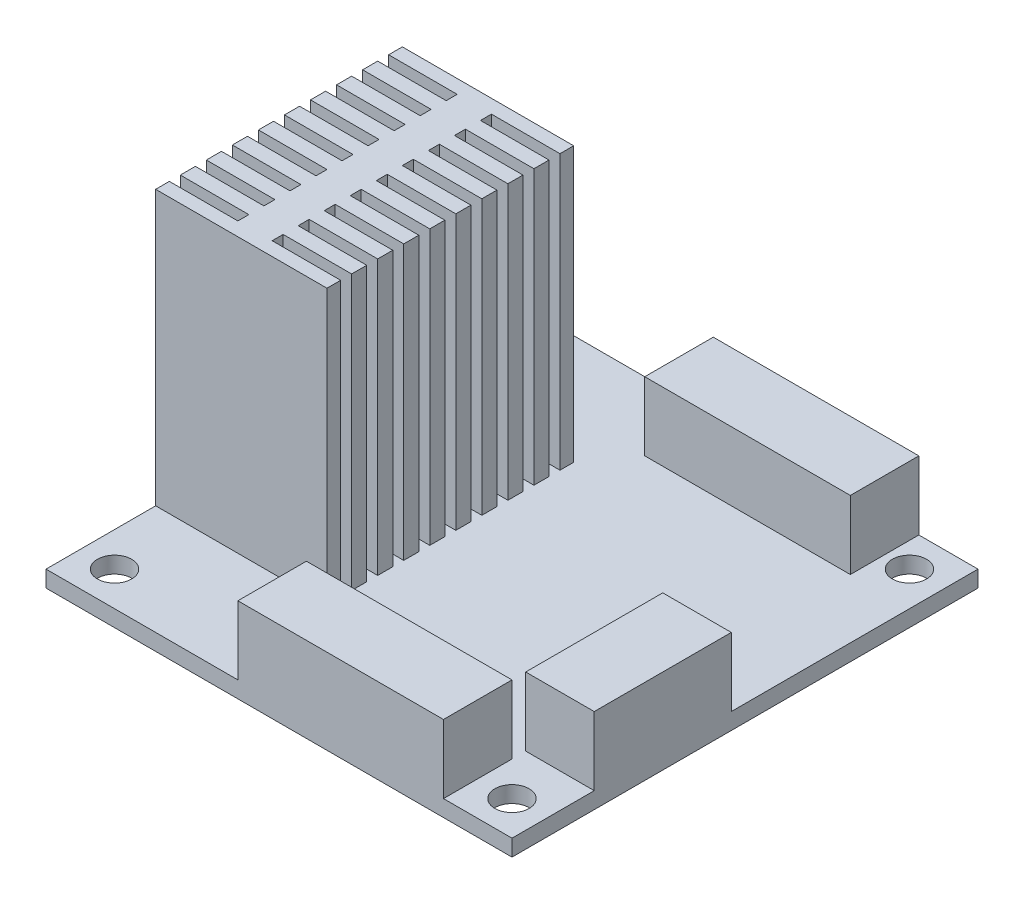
ISO-10303-21;
HEADER;
FILE_DESCRIPTION(('STEP AP214'),'2;1');
FILE_NAME('part.step','',(''),(''),'','','');
FILE_SCHEMA(('AUTOMOTIVE_DESIGN { 1 0 10303 214 1 1 1 1 }'));
ENDSEC;
DATA;
#1=APPLICATION_CONTEXT('core data for automotive mechanical design processes');
#2=APPLICATION_PROTOCOL_DEFINITION('international standard','automotive_design',2000,#1);
#3=PRODUCT_CONTEXT('',#1,'mechanical');
#4=PRODUCT('Part','Part','',(#3));
#5=PRODUCT_RELATED_PRODUCT_CATEGORY('part','',(#4));
#6=PRODUCT_DEFINITION_FORMATION('','',#4);
#7=PRODUCT_DEFINITION_CONTEXT('part definition',#1,'design');
#8=PRODUCT_DEFINITION('design','',#6,#7);
#9=PRODUCT_DEFINITION_SHAPE('','',#8);
#10=(LENGTH_UNIT() NAMED_UNIT(*) SI_UNIT(.MILLI.,.METRE.));
#11=(NAMED_UNIT(*) PLANE_ANGLE_UNIT() SI_UNIT($,.RADIAN.));
#12=(NAMED_UNIT(*) SI_UNIT($,.STERADIAN.) SOLID_ANGLE_UNIT());
#13=UNCERTAINTY_MEASURE_WITH_UNIT(LENGTH_MEASURE(1.E-05),#10,'distance_accuracy_value','');
#14=(GEOMETRIC_REPRESENTATION_CONTEXT(3) GLOBAL_UNCERTAINTY_ASSIGNED_CONTEXT((#13)) GLOBAL_UNIT_ASSIGNED_CONTEXT((#10,
#11,#12)) REPRESENTATION_CONTEXT('',''));
#15=CARTESIAN_POINT('',(0.,0.,0.));
#16=DIRECTION('',(0.,0.,1.));
#17=DIRECTION('',(1.,0.,0.));
#18=AXIS2_PLACEMENT_3D('',#15,#16,#17);
#19=CARTESIAN_POINT('',(0.,1.524,0.));
#20=DIRECTION('',(0.,-1.,0.));
#21=DIRECTION('',(0.,0.,-1.));
#22=AXIS2_PLACEMENT_3D('',#19,#20,#21);
#23=PLANE('',#22);
#24=CARTESIAN_POINT('',(3.175,1.524,-3.175));
#25=DIRECTION('',(0.,1.,0.));
#26=DIRECTION('',(0.,0.,1.));
#27=AXIS2_PLACEMENT_3D('',#24,#25,#26);
#28=CIRCLE('',#27,1.5875);
#29=CARTESIAN_POINT('',(3.175,1.524,-1.5875));
#30=VERTEX_POINT('',#29);
#31=EDGE_CURVE('E2807',#30,#30,#28,.T.);
#32=ORIENTED_EDGE('',*,*,#31,.F.);
#33=EDGE_LOOP('',(#32));
#34=FACE_BOUND('',#33,.T.);
#35=CARTESIAN_POINT('',(40.005,1.524,-3.175));
#36=DIRECTION('',(0.,1.,0.));
#37=DIRECTION('',(0.,0.,1.));
#38=AXIS2_PLACEMENT_3D('',#35,#36,#37);
#39=CIRCLE('',#38,1.5875);
#40=CARTESIAN_POINT('',(40.005,1.524,-1.5875));
#41=VERTEX_POINT('',#40);
#42=EDGE_CURVE('E2804',#41,#41,#39,.T.);
#43=ORIENTED_EDGE('',*,*,#42,.F.);
#44=EDGE_LOOP('',(#43));
#45=FACE_BOUND('',#44,.T.);
#46=CARTESIAN_POINT('',(40.005,1.524,-40.005));
#47=DIRECTION('',(0.,1.,0.));
#48=DIRECTION('',(0.,0.,1.));
#49=AXIS2_PLACEMENT_3D('',#46,#47,#48);
#50=CIRCLE('',#49,1.5875);
#51=CARTESIAN_POINT('',(40.005,1.524,-38.4175));
#52=VERTEX_POINT('',#51);
#53=EDGE_CURVE('E2806',#52,#52,#50,.T.);
#54=ORIENTED_EDGE('',*,*,#53,.F.);
#55=EDGE_LOOP('',(#54));
#56=FACE_BOUND('',#55,.T.);
#57=CARTESIAN_POINT('',(3.17499999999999,1.524,-40.005));
#58=DIRECTION('',(0.,1.,0.));
#59=DIRECTION('',(0.,0.,1.));
#60=AXIS2_PLACEMENT_3D('',#57,#58,#59);
#61=CIRCLE('',#60,1.5875);
#62=CARTESIAN_POINT('',(3.17499999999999,1.524,-38.4175));
#63=VERTEX_POINT('',#62);
#64=EDGE_CURVE('E647',#63,#63,#61,.T.);
#65=ORIENTED_EDGE('',*,*,#64,.F.);
#66=EDGE_LOOP('',(#65));
#67=FACE_BOUND('',#66,.T.);
#68=DIRECTION('',(1.,0.,0.));
#69=VECTOR('',#68,1.);
#70=CARTESIAN_POINT('',(0.,1.524,0.));
#71=LINE('',#70,#69);
#72=CARTESIAN_POINT('',(0.,1.524,0.));
#73=VERTEX_POINT('',#72);
#74=CARTESIAN_POINT('',(17.78,1.524,0.));
#75=VERTEX_POINT('',#74);
#76=EDGE_CURVE('E1551',#73,#75,#71,.T.);
#77=ORIENTED_EDGE('',*,*,#76,.T.);
#78=DIRECTION('',(0.,0.,-1.));
#79=VECTOR('',#78,1.);
#80=CARTESIAN_POINT('',(17.78,1.524,0.));
#81=LINE('',#80,#79);
#82=CARTESIAN_POINT('',(17.78,1.524,-6.35));
#83=VERTEX_POINT('',#82);
#84=EDGE_CURVE('E63',#75,#83,#81,.T.);
#85=ORIENTED_EDGE('',*,*,#84,.T.);
#86=DIRECTION('',(1.,0.,0.));
#87=VECTOR('',#86,1.);
#88=CARTESIAN_POINT('',(17.78,1.524,-6.35));
#89=LINE('',#88,#87);
#90=CARTESIAN_POINT('',(36.83,1.524,-6.35));
#91=VERTEX_POINT('',#90);
#92=EDGE_CURVE('E68',#83,#91,#89,.T.);
#93=ORIENTED_EDGE('',*,*,#92,.T.);
#94=DIRECTION('',(0.,0.,-1.));
#95=VECTOR('',#94,1.);
#96=CARTESIAN_POINT('',(36.83,1.524,0.));
#97=LINE('',#96,#95);
#98=CARTESIAN_POINT('',(36.83,1.524,0.));
#99=VERTEX_POINT('',#98);
#100=EDGE_CURVE('E634',#99,#91,#97,.T.);
#101=ORIENTED_EDGE('',*,*,#100,.F.);
#102=CARTESIAN_POINT('',(43.18,1.524,0.));
#103=VERTEX_POINT('',#102);
#104=EDGE_CURVE('E1548',#99,#103,#71,.T.);
#105=ORIENTED_EDGE('',*,*,#104,.T.);
#106=DIRECTION('',(0.,0.,-1.));
#107=VECTOR('',#106,1.);
#108=CARTESIAN_POINT('',(43.18,1.524,0.));
#109=LINE('',#108,#107);
#110=CARTESIAN_POINT('',(43.18,1.524,-7.62));
#111=VERTEX_POINT('',#110);
#112=EDGE_CURVE('E1555',#103,#111,#109,.T.);
#113=ORIENTED_EDGE('',*,*,#112,.T.);
#114=DIRECTION('',(-1.,0.,0.));
#115=VECTOR('',#114,1.);
#116=CARTESIAN_POINT('',(43.18,1.524,-7.62));
#117=LINE('',#116,#115);
#118=CARTESIAN_POINT('',(36.83,1.524,-7.62));
#119=VERTEX_POINT('',#118);
#120=EDGE_CURVE('E686',#111,#119,#117,.T.);
#121=ORIENTED_EDGE('',*,*,#120,.T.);
#122=DIRECTION('',(0.,0.,-1.));
#123=VECTOR('',#122,1.);
#124=CARTESIAN_POINT('',(36.83,1.524,-7.62));
#125=LINE('',#124,#123);
#126=CARTESIAN_POINT('',(36.83,1.524,-20.32));
#127=VERTEX_POINT('',#126);
#128=EDGE_CURVE('E689',#119,#127,#125,.T.);
#129=ORIENTED_EDGE('',*,*,#128,.T.);
#130=DIRECTION('',(-1.,0.,0.));
#131=VECTOR('',#130,1.);
#132=CARTESIAN_POINT('',(43.18,1.524,-20.32));
#133=LINE('',#132,#131);
#134=CARTESIAN_POINT('',(43.18,1.524,-20.32));
#135=VERTEX_POINT('',#134);
#136=EDGE_CURVE('E656',#135,#127,#133,.T.);
#137=ORIENTED_EDGE('',*,*,#136,.F.);
#138=CARTESIAN_POINT('',(43.18,1.524,-43.18));
#139=VERTEX_POINT('',#138);
#140=EDGE_CURVE('E1554',#135,#139,#109,.T.);
#141=ORIENTED_EDGE('',*,*,#140,.T.);
#142=DIRECTION('',(-1.,0.,0.));
#143=VECTOR('',#142,1.);
#144=CARTESIAN_POINT('',(0.,1.524,-43.18));
#145=LINE('',#144,#143);
#146=CARTESIAN_POINT('',(37.7003981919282,1.524,-43.18));
#147=VERTEX_POINT('',#146);
#148=EDGE_CURVE('E1559',#139,#147,#145,.T.);
#149=ORIENTED_EDGE('',*,*,#148,.T.);
#150=DIRECTION('',(0.,0.,1.));
#151=VECTOR('',#150,1.);
#152=CARTESIAN_POINT('',(37.7003981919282,1.524,-43.18));
#153=LINE('',#152,#151);
#154=CARTESIAN_POINT('',(37.7003981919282,1.524,-36.83));
#155=VERTEX_POINT('',#154);
#156=EDGE_CURVE('E729',#147,#155,#153,.T.);
#157=ORIENTED_EDGE('',*,*,#156,.T.);
#158=DIRECTION('',(1.,0.,0.));
#159=VECTOR('',#158,1.);
#160=CARTESIAN_POINT('',(18.6503981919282,1.524,-36.83));
#161=LINE('',#160,#159);
#162=CARTESIAN_POINT('',(18.6503981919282,1.524,-36.83));
#163=VERTEX_POINT('',#162);
#164=EDGE_CURVE('E673',#163,#155,#161,.T.);
#165=ORIENTED_EDGE('',*,*,#164,.F.);
#166=DIRECTION('',(0.,0.,1.));
#167=VECTOR('',#166,1.);
#168=CARTESIAN_POINT('',(18.6503981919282,1.524,-43.18));
#169=LINE('',#168,#167);
#170=CARTESIAN_POINT('',(18.6503981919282,1.524,-43.18));
#171=VERTEX_POINT('',#170);
#172=EDGE_CURVE('E725',#171,#163,#169,.T.);
#173=ORIENTED_EDGE('',*,*,#172,.F.);
#174=CARTESIAN_POINT('',(0.,1.524,-43.18));
#175=VERTEX_POINT('',#174);
#176=EDGE_CURVE('E1558',#171,#175,#145,.T.);
#177=ORIENTED_EDGE('',*,*,#176,.T.);
#178=DIRECTION('',(0.,0.,1.));
#179=VECTOR('',#178,1.);
#180=CARTESIAN_POINT('',(0.,1.524,0.));
#181=LINE('',#180,#179);
#182=CARTESIAN_POINT('',(0.,1.524,-33.02));
#183=VERTEX_POINT('',#182);
#184=EDGE_CURVE('E1545',#175,#183,#181,.T.);
#185=ORIENTED_EDGE('',*,*,#184,.T.);
#186=DIRECTION('',(-1.,0.,0.));
#187=VECTOR('',#186,1.);
#188=CARTESIAN_POINT('',(0.,1.524,-33.02));
#189=LINE('',#188,#187);
#190=CARTESIAN_POINT('',(15.875,1.524,-33.02));
#191=VERTEX_POINT('',#190);
#192=EDGE_CURVE('E1130',#191,#183,#189,.T.);
#193=ORIENTED_EDGE('',*,*,#192,.F.);
#194=DIRECTION('',(0.,0.,-1.));
#195=VECTOR('',#194,1.);
#196=CARTESIAN_POINT('',(15.875,1.524,-31.75));
#197=LINE('',#196,#195);
#198=CARTESIAN_POINT('',(15.875,1.524,-31.75));
#199=VERTEX_POINT('',#198);
#200=EDGE_CURVE('E1126',#199,#191,#197,.T.);
#201=ORIENTED_EDGE('',*,*,#200,.F.);
#202=DIRECTION('',(1.,0.,0.));
#203=VECTOR('',#202,1.);
#204=CARTESIAN_POINT('',(15.875,1.524,-31.75));
#205=LINE('',#204,#203);
#206=CARTESIAN_POINT('',(9.52499999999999,1.524,-31.75));
#207=VERTEX_POINT('',#206);
#208=EDGE_CURVE('E1122',#207,#199,#205,.T.);
#209=ORIENTED_EDGE('',*,*,#208,.F.);
#210=DIRECTION('',(0.,0.,-1.));
#211=VECTOR('',#210,1.);
#212=CARTESIAN_POINT('',(9.52499999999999,1.524,-31.75));
#213=LINE('',#212,#211);
#214=CARTESIAN_POINT('',(9.52499999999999,1.524,-30.734));
#215=VERTEX_POINT('',#214);
#216=EDGE_CURVE('E1118',#215,#207,#213,.T.);
#217=ORIENTED_EDGE('',*,*,#216,.F.);
#218=DIRECTION('',(-1.,0.,0.));
#219=VECTOR('',#218,1.);
#220=CARTESIAN_POINT('',(15.875,1.524,-30.734));
#221=LINE('',#220,#219);
#222=CARTESIAN_POINT('',(15.875,1.524,-30.734));
#223=VERTEX_POINT('',#222);
#224=EDGE_CURVE('E1114',#223,#215,#221,.T.);
#225=ORIENTED_EDGE('',*,*,#224,.F.);
#226=DIRECTION('',(0.,0.,-1.));
#227=VECTOR('',#226,1.);
#228=CARTESIAN_POINT('',(15.875,1.524,-29.337));
#229=LINE('',#228,#227);
#230=CARTESIAN_POINT('',(15.875,1.524,-29.337));
#231=VERTEX_POINT('',#230);
#232=EDGE_CURVE('E1110',#231,#223,#229,.T.);
#233=ORIENTED_EDGE('',*,*,#232,.F.);
#234=DIRECTION('',(1.,0.,0.));
#235=VECTOR('',#234,1.);
#236=CARTESIAN_POINT('',(15.875,1.524,-29.337));
#237=LINE('',#236,#235);
#238=CARTESIAN_POINT('',(9.52499999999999,1.524,-29.337));
#239=VERTEX_POINT('',#238);
#240=EDGE_CURVE('E1106',#239,#231,#237,.T.);
#241=ORIENTED_EDGE('',*,*,#240,.F.);
#242=DIRECTION('',(0.,0.,-1.));
#243=VECTOR('',#242,1.);
#244=CARTESIAN_POINT('',(9.52499999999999,1.524,-29.337));
#245=LINE('',#244,#243);
#246=CARTESIAN_POINT('',(9.52499999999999,1.524,-28.321));
#247=VERTEX_POINT('',#246);
#248=EDGE_CURVE('E1102',#247,#239,#245,.T.);
#249=ORIENTED_EDGE('',*,*,#248,.F.);
#250=DIRECTION('',(-1.,0.,0.));
#251=VECTOR('',#250,1.);
#252=CARTESIAN_POINT('',(15.875,1.524,-28.321));
#253=LINE('',#252,#251);
#254=CARTESIAN_POINT('',(15.875,1.524,-28.321));
#255=VERTEX_POINT('',#254);
#256=EDGE_CURVE('E1098',#255,#247,#253,.T.);
#257=ORIENTED_EDGE('',*,*,#256,.F.);
#258=DIRECTION('',(0.,0.,-1.));
#259=VECTOR('',#258,1.);
#260=CARTESIAN_POINT('',(15.875,1.524,-26.924));
#261=LINE('',#260,#259);
#262=CARTESIAN_POINT('',(15.875,1.524,-26.924));
#263=VERTEX_POINT('',#262);
#264=EDGE_CURVE('E1094',#263,#255,#261,.T.);
#265=ORIENTED_EDGE('',*,*,#264,.F.);
#266=DIRECTION('',(1.,0.,0.));
#267=VECTOR('',#266,1.);
#268=CARTESIAN_POINT('',(15.875,1.524,-26.924));
#269=LINE('',#268,#267);
#270=CARTESIAN_POINT('',(9.52499999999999,1.524,-26.924));
#271=VERTEX_POINT('',#270);
#272=EDGE_CURVE('E1090',#271,#263,#269,.T.);
#273=ORIENTED_EDGE('',*,*,#272,.F.);
#274=DIRECTION('',(0.,0.,-1.));
#275=VECTOR('',#274,1.);
#276=CARTESIAN_POINT('',(9.52499999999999,1.524,-26.924));
#277=LINE('',#276,#275);
#278=CARTESIAN_POINT('',(9.52499999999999,1.524,-25.908));
#279=VERTEX_POINT('',#278);
#280=EDGE_CURVE('E1086',#279,#271,#277,.T.);
#281=ORIENTED_EDGE('',*,*,#280,.F.);
#282=DIRECTION('',(-1.,0.,0.));
#283=VECTOR('',#282,1.);
#284=CARTESIAN_POINT('',(15.875,1.524,-25.908));
#285=LINE('',#284,#283);
#286=CARTESIAN_POINT('',(15.875,1.524,-25.908));
#287=VERTEX_POINT('',#286);
#288=EDGE_CURVE('E1082',#287,#279,#285,.T.);
#289=ORIENTED_EDGE('',*,*,#288,.F.);
#290=DIRECTION('',(0.,0.,-1.));
#291=VECTOR('',#290,1.);
#292=CARTESIAN_POINT('',(15.875,1.524,-24.511));
#293=LINE('',#292,#291);
#294=CARTESIAN_POINT('',(15.875,1.524,-24.511));
#295=VERTEX_POINT('',#294);
#296=EDGE_CURVE('E1078',#295,#287,#293,.T.);
#297=ORIENTED_EDGE('',*,*,#296,.F.);
#298=DIRECTION('',(1.,0.,0.));
#299=VECTOR('',#298,1.);
#300=CARTESIAN_POINT('',(15.875,1.524,-24.511));
#301=LINE('',#300,#299);
#302=CARTESIAN_POINT('',(9.52499999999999,1.524,-24.511));
#303=VERTEX_POINT('',#302);
#304=EDGE_CURVE('E1074',#303,#295,#301,.T.);
#305=ORIENTED_EDGE('',*,*,#304,.F.);
#306=DIRECTION('',(0.,0.,-1.));
#307=VECTOR('',#306,1.);
#308=CARTESIAN_POINT('',(9.52499999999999,1.524,-24.511));
#309=LINE('',#308,#307);
#310=CARTESIAN_POINT('',(9.52499999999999,1.524,-23.495));
#311=VERTEX_POINT('',#310);
#312=EDGE_CURVE('E1070',#311,#303,#309,.T.);
#313=ORIENTED_EDGE('',*,*,#312,.F.);
#314=DIRECTION('',(-1.,0.,0.));
#315=VECTOR('',#314,1.);
#316=CARTESIAN_POINT('',(15.875,1.524,-23.495));
#317=LINE('',#316,#315);
#318=CARTESIAN_POINT('',(15.875,1.524,-23.495));
#319=VERTEX_POINT('',#318);
#320=EDGE_CURVE('E1066',#319,#311,#317,.T.);
#321=ORIENTED_EDGE('',*,*,#320,.F.);
#322=DIRECTION('',(0.,0.,-1.));
#323=VECTOR('',#322,1.);
#324=CARTESIAN_POINT('',(15.875,1.524,-22.098));
#325=LINE('',#324,#323);
#326=CARTESIAN_POINT('',(15.875,1.524,-22.098));
#327=VERTEX_POINT('',#326);
#328=EDGE_CURVE('E1062',#327,#319,#325,.T.);
#329=ORIENTED_EDGE('',*,*,#328,.F.);
#330=DIRECTION('',(1.,0.,0.));
#331=VECTOR('',#330,1.);
#332=CARTESIAN_POINT('',(15.875,1.524,-22.098));
#333=LINE('',#332,#331);
#334=CARTESIAN_POINT('',(9.52499999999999,1.524,-22.098));
#335=VERTEX_POINT('',#334);
#336=EDGE_CURVE('E1058',#335,#327,#333,.T.);
#337=ORIENTED_EDGE('',*,*,#336,.F.);
#338=DIRECTION('',(0.,0.,-1.));
#339=VECTOR('',#338,1.);
#340=CARTESIAN_POINT('',(9.52499999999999,1.524,-22.098));
#341=LINE('',#340,#339);
#342=CARTESIAN_POINT('',(9.52499999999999,1.524,-21.082));
#343=VERTEX_POINT('',#342);
#344=EDGE_CURVE('E1054',#343,#335,#341,.T.);
#345=ORIENTED_EDGE('',*,*,#344,.F.);
#346=DIRECTION('',(-1.,0.,0.));
#347=VECTOR('',#346,1.);
#348=CARTESIAN_POINT('',(15.875,1.524,-21.082));
#349=LINE('',#348,#347);
#350=CARTESIAN_POINT('',(15.875,1.524,-21.082));
#351=VERTEX_POINT('',#350);
#352=EDGE_CURVE('E1050',#351,#343,#349,.T.);
#353=ORIENTED_EDGE('',*,*,#352,.F.);
#354=DIRECTION('',(0.,0.,-1.));
#355=VECTOR('',#354,1.);
#356=CARTESIAN_POINT('',(15.875,1.524,-19.685));
#357=LINE('',#356,#355);
#358=CARTESIAN_POINT('',(15.875,1.524,-19.685));
#359=VERTEX_POINT('',#358);
#360=EDGE_CURVE('E1046',#359,#351,#357,.T.);
#361=ORIENTED_EDGE('',*,*,#360,.F.);
#362=DIRECTION('',(1.,0.,0.));
#363=VECTOR('',#362,1.);
#364=CARTESIAN_POINT('',(15.875,1.524,-19.685));
#365=LINE('',#364,#363);
#366=CARTESIAN_POINT('',(9.52499999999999,1.524,-19.685));
#367=VERTEX_POINT('',#366);
#368=EDGE_CURVE('E1042',#367,#359,#365,.T.);
#369=ORIENTED_EDGE('',*,*,#368,.F.);
#370=DIRECTION('',(0.,0.,-1.));
#371=VECTOR('',#370,1.);
#372=CARTESIAN_POINT('',(9.52499999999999,1.524,-19.685));
#373=LINE('',#372,#371);
#374=CARTESIAN_POINT('',(9.52499999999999,1.524,-18.669));
#375=VERTEX_POINT('',#374);
#376=EDGE_CURVE('E1038',#375,#367,#373,.T.);
#377=ORIENTED_EDGE('',*,*,#376,.F.);
#378=DIRECTION('',(-1.,0.,0.));
#379=VECTOR('',#378,1.);
#380=CARTESIAN_POINT('',(15.875,1.524,-18.669));
#381=LINE('',#380,#379);
#382=CARTESIAN_POINT('',(15.875,1.524,-18.669));
#383=VERTEX_POINT('',#382);
#384=EDGE_CURVE('E1034',#383,#375,#381,.T.);
#385=ORIENTED_EDGE('',*,*,#384,.F.);
#386=DIRECTION('',(0.,0.,-1.));
#387=VECTOR('',#386,1.);
#388=CARTESIAN_POINT('',(15.875,1.524,-17.272));
#389=LINE('',#388,#387);
#390=CARTESIAN_POINT('',(15.875,1.524,-17.272));
#391=VERTEX_POINT('',#390);
#392=EDGE_CURVE('E1030',#391,#383,#389,.T.);
#393=ORIENTED_EDGE('',*,*,#392,.F.);
#394=DIRECTION('',(1.,0.,0.));
#395=VECTOR('',#394,1.);
#396=CARTESIAN_POINT('',(15.875,1.524,-17.272));
#397=LINE('',#396,#395);
#398=CARTESIAN_POINT('',(9.52499999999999,1.524,-17.272));
#399=VERTEX_POINT('',#398);
#400=EDGE_CURVE('E1026',#399,#391,#397,.T.);
#401=ORIENTED_EDGE('',*,*,#400,.F.);
#402=DIRECTION('',(0.,0.,-1.));
#403=VECTOR('',#402,1.);
#404=CARTESIAN_POINT('',(9.52499999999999,1.524,-17.272));
#405=LINE('',#404,#403);
#406=CARTESIAN_POINT('',(9.52499999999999,1.524,-16.256));
#407=VERTEX_POINT('',#406);
#408=EDGE_CURVE('E1022',#407,#399,#405,.T.);
#409=ORIENTED_EDGE('',*,*,#408,.F.);
#410=DIRECTION('',(-1.,0.,0.));
#411=VECTOR('',#410,1.);
#412=CARTESIAN_POINT('',(15.875,1.524,-16.256));
#413=LINE('',#412,#411);
#414=CARTESIAN_POINT('',(15.875,1.524,-16.256));
#415=VERTEX_POINT('',#414);
#416=EDGE_CURVE('E1018',#415,#407,#413,.T.);
#417=ORIENTED_EDGE('',*,*,#416,.F.);
#418=DIRECTION('',(0.,0.,-1.));
#419=VECTOR('',#418,1.);
#420=CARTESIAN_POINT('',(15.875,1.524,-14.859));
#421=LINE('',#420,#419);
#422=CARTESIAN_POINT('',(15.875,1.524,-14.859));
#423=VERTEX_POINT('',#422);
#424=EDGE_CURVE('E1014',#423,#415,#421,.T.);
#425=ORIENTED_EDGE('',*,*,#424,.F.);
#426=DIRECTION('',(1.,0.,0.));
#427=VECTOR('',#426,1.);
#428=CARTESIAN_POINT('',(15.875,1.524,-14.859));
#429=LINE('',#428,#427);
#430=CARTESIAN_POINT('',(9.52499999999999,1.524,-14.859));
#431=VERTEX_POINT('',#430);
#432=EDGE_CURVE('E1010',#431,#423,#429,.T.);
#433=ORIENTED_EDGE('',*,*,#432,.F.);
#434=DIRECTION('',(0.,0.,-1.));
#435=VECTOR('',#434,1.);
#436=CARTESIAN_POINT('',(9.52499999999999,1.524,-14.859));
#437=LINE('',#436,#435);
#438=CARTESIAN_POINT('',(9.52499999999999,1.524,-13.843));
#439=VERTEX_POINT('',#438);
#440=EDGE_CURVE('E1006',#439,#431,#437,.T.);
#441=ORIENTED_EDGE('',*,*,#440,.F.);
#442=DIRECTION('',(-1.,0.,0.));
#443=VECTOR('',#442,1.);
#444=CARTESIAN_POINT('',(15.875,1.524,-13.843));
#445=LINE('',#444,#443);
#446=CARTESIAN_POINT('',(15.875,1.524,-13.843));
#447=VERTEX_POINT('',#446);
#448=EDGE_CURVE('E1002',#447,#439,#445,.T.);
#449=ORIENTED_EDGE('',*,*,#448,.F.);
#450=DIRECTION('',(0.,0.,-1.));
#451=VECTOR('',#450,1.);
#452=CARTESIAN_POINT('',(15.875,1.524,-12.446));
#453=LINE('',#452,#451);
#454=CARTESIAN_POINT('',(15.875,1.524,-12.446));
#455=VERTEX_POINT('',#454);
#456=EDGE_CURVE('E998',#455,#447,#453,.T.);
#457=ORIENTED_EDGE('',*,*,#456,.F.);
#458=DIRECTION('',(1.,0.,0.));
#459=VECTOR('',#458,1.);
#460=CARTESIAN_POINT('',(15.875,1.524,-12.446));
#461=LINE('',#460,#459);
#462=CARTESIAN_POINT('',(9.52499999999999,1.524,-12.446));
#463=VERTEX_POINT('',#462);
#464=EDGE_CURVE('E994',#463,#455,#461,.T.);
#465=ORIENTED_EDGE('',*,*,#464,.F.);
#466=DIRECTION('',(0.,0.,-1.));
#467=VECTOR('',#466,1.);
#468=CARTESIAN_POINT('',(9.52499999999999,1.524,-12.446));
#469=LINE('',#468,#467);
#470=CARTESIAN_POINT('',(9.52499999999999,1.524,-11.43));
#471=VERTEX_POINT('',#470);
#472=EDGE_CURVE('E990',#471,#463,#469,.T.);
#473=ORIENTED_EDGE('',*,*,#472,.F.);
#474=DIRECTION('',(-1.,0.,0.));
#475=VECTOR('',#474,1.);
#476=CARTESIAN_POINT('',(15.875,1.524,-11.43));
#477=LINE('',#476,#475);
#478=CARTESIAN_POINT('',(15.875,1.524,-11.43));
#479=VERTEX_POINT('',#478);
#480=EDGE_CURVE('E986',#479,#471,#477,.T.);
#481=ORIENTED_EDGE('',*,*,#480,.F.);
#482=DIRECTION('',(0.,0.,-1.));
#483=VECTOR('',#482,1.);
#484=CARTESIAN_POINT('',(15.875,1.524,-10.16));
#485=LINE('',#484,#483);
#486=CARTESIAN_POINT('',(15.875,1.524,-10.16));
#487=VERTEX_POINT('',#486);
#488=EDGE_CURVE('E982',#487,#479,#485,.T.);
#489=ORIENTED_EDGE('',*,*,#488,.F.);
#490=DIRECTION('',(1.,0.,0.));
#491=VECTOR('',#490,1.);
#492=CARTESIAN_POINT('',(0.,1.524,-10.16));
#493=LINE('',#492,#491);
#494=CARTESIAN_POINT('',(0.,1.524,-10.16));
#495=VERTEX_POINT('',#494);
#496=EDGE_CURVE('E661',#495,#487,#493,.T.);
#497=ORIENTED_EDGE('',*,*,#496,.F.);
#498=EDGE_CURVE('E1550',#495,#73,#181,.T.);
#499=ORIENTED_EDGE('',*,*,#498,.T.);
#500=EDGE_LOOP('',(#77,#85,#93,#101,#105,#113,#121,#129,#137,#141,#149,#157,#165,#173,#177,#185,
#193,#201,#209,#217,#225,#233,#241,#249,#257,#265,#273,#281,#289,#297,#305,#313,#321,#329,#337,
#345,#353,#361,#369,#377,#385,#393,#401,#409,#417,#425,#433,#441,#449,#457,#465,#473,#481,#489,
#497,#499));
#501=FACE_BOUND('',#500,.T.);
#502=ADVANCED_FACE('F45',(#34,#45,#56,#67,#501),#23,.F.);
#503=DIRECTION('',(1.,0.,0.));
#504=VECTOR('',#503,1.);
#505=CARTESIAN_POINT('',(0.,1.524,-31.75));
#506=LINE('',#505,#504);
#507=CARTESIAN_POINT('',(0.,1.524,-31.75));
#508=VERTEX_POINT('',#507);
#509=CARTESIAN_POINT('',(6.34999999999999,1.524,-31.75));
#510=VERTEX_POINT('',#509);
#511=EDGE_CURVE('E1134',#508,#510,#506,.T.);
#512=ORIENTED_EDGE('',*,*,#511,.F.);
#513=CARTESIAN_POINT('',(0.,1.524,-30.734));
#514=VERTEX_POINT('',#513);
#515=EDGE_CURVE('E1549',#508,#514,#181,.T.);
#516=ORIENTED_EDGE('',*,*,#515,.T.);
#517=DIRECTION('',(-1.,0.,0.));
#518=VECTOR('',#517,1.);
#519=CARTESIAN_POINT('',(0.,1.524,-30.734));
#520=LINE('',#519,#518);
#521=CARTESIAN_POINT('',(6.34999999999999,1.524,-30.734));
#522=VERTEX_POINT('',#521);
#523=EDGE_CURVE('E1142',#522,#514,#520,.T.);
#524=ORIENTED_EDGE('',*,*,#523,.F.);
#525=DIRECTION('',(0.,0.,1.));
#526=VECTOR('',#525,1.);
#527=CARTESIAN_POINT('',(6.34999999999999,1.524,-31.75));
#528=LINE('',#527,#526);
#529=EDGE_CURVE('E1138',#510,#522,#528,.T.);
#530=ORIENTED_EDGE('',*,*,#529,.F.);
#531=EDGE_LOOP('',(#512,#516,#524,#530));
#532=FACE_BOUND('',#531,.T.);
#533=ADVANCED_FACE('F1673',(#532),#23,.F.);
#534=DIRECTION('',(1.,0.,0.));
#535=VECTOR('',#534,1.);
#536=CARTESIAN_POINT('',(0.,1.524,-29.337));
#537=LINE('',#536,#535);
#538=CARTESIAN_POINT('',(0.,1.524,-29.337));
#539=VERTEX_POINT('',#538);
#540=CARTESIAN_POINT('',(6.34999999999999,1.524,-29.337));
#541=VERTEX_POINT('',#540);
#542=EDGE_CURVE('E1146',#539,#541,#537,.T.);
#543=ORIENTED_EDGE('',*,*,#542,.F.);
#544=CARTESIAN_POINT('',(0.,1.524,-28.321));
#545=VERTEX_POINT('',#544);
#546=EDGE_CURVE('E1664',#539,#545,#181,.T.);
#547=ORIENTED_EDGE('',*,*,#546,.T.);
#548=DIRECTION('',(-1.,0.,0.));
#549=VECTOR('',#548,1.);
#550=CARTESIAN_POINT('',(0.,1.524,-28.321));
#551=LINE('',#550,#549);
#552=CARTESIAN_POINT('',(6.34999999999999,1.524,-28.321));
#553=VERTEX_POINT('',#552);
#554=EDGE_CURVE('E1154',#553,#545,#551,.T.);
#555=ORIENTED_EDGE('',*,*,#554,.F.);
#556=DIRECTION('',(0.,0.,1.));
#557=VECTOR('',#556,1.);
#558=CARTESIAN_POINT('',(6.34999999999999,1.524,-29.337));
#559=LINE('',#558,#557);
#560=EDGE_CURVE('E1150',#541,#553,#559,.T.);
#561=ORIENTED_EDGE('',*,*,#560,.F.);
#562=EDGE_LOOP('',(#543,#547,#555,#561));
#563=FACE_BOUND('',#562,.T.);
#564=ADVANCED_FACE('F1960',(#563),#23,.F.);
#565=DIRECTION('',(1.,0.,0.));
#566=VECTOR('',#565,1.);
#567=CARTESIAN_POINT('',(0.,1.524,-26.924));
#568=LINE('',#567,#566);
#569=CARTESIAN_POINT('',(0.,1.524,-26.924));
#570=VERTEX_POINT('',#569);
#571=CARTESIAN_POINT('',(6.34999999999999,1.524,-26.924));
#572=VERTEX_POINT('',#571);
#573=EDGE_CURVE('E1158',#570,#572,#568,.T.);
#574=ORIENTED_EDGE('',*,*,#573,.F.);
#575=CARTESIAN_POINT('',(0.,1.524,-25.908));
#576=VERTEX_POINT('',#575);
#577=EDGE_CURVE('E1660',#570,#576,#181,.T.);
#578=ORIENTED_EDGE('',*,*,#577,.T.);
#579=DIRECTION('',(-1.,0.,0.));
#580=VECTOR('',#579,1.);
#581=CARTESIAN_POINT('',(0.,1.524,-25.908));
#582=LINE('',#581,#580);
#583=CARTESIAN_POINT('',(6.34999999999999,1.524,-25.908));
#584=VERTEX_POINT('',#583);
#585=EDGE_CURVE('E1166',#584,#576,#582,.T.);
#586=ORIENTED_EDGE('',*,*,#585,.F.);
#587=DIRECTION('',(0.,0.,1.));
#588=VECTOR('',#587,1.);
#589=CARTESIAN_POINT('',(6.34999999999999,1.524,-26.924));
#590=LINE('',#589,#588);
#591=EDGE_CURVE('E1162',#572,#584,#590,.T.);
#592=ORIENTED_EDGE('',*,*,#591,.F.);
#593=EDGE_LOOP('',(#574,#578,#586,#592));
#594=FACE_BOUND('',#593,.T.);
#595=ADVANCED_FACE('F1945',(#594),#23,.F.);
#596=DIRECTION('',(1.,0.,0.));
#597=VECTOR('',#596,1.);
#598=CARTESIAN_POINT('',(0.,1.524,-24.511));
#599=LINE('',#598,#597);
#600=CARTESIAN_POINT('',(0.,1.524,-24.511));
#601=VERTEX_POINT('',#600);
#602=CARTESIAN_POINT('',(6.34999999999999,1.524,-24.511));
#603=VERTEX_POINT('',#602);
#604=EDGE_CURVE('E1170',#601,#603,#599,.T.);
#605=ORIENTED_EDGE('',*,*,#604,.F.);
#606=CARTESIAN_POINT('',(0.,1.524,-23.495));
#607=VERTEX_POINT('',#606);
#608=EDGE_CURVE('E1656',#601,#607,#181,.T.);
#609=ORIENTED_EDGE('',*,*,#608,.T.);
#610=DIRECTION('',(-1.,0.,0.));
#611=VECTOR('',#610,1.);
#612=CARTESIAN_POINT('',(0.,1.524,-23.495));
#613=LINE('',#612,#611);
#614=CARTESIAN_POINT('',(6.34999999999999,1.524,-23.495));
#615=VERTEX_POINT('',#614);
#616=EDGE_CURVE('E1178',#615,#607,#613,.T.);
#617=ORIENTED_EDGE('',*,*,#616,.F.);
#618=DIRECTION('',(0.,0.,1.));
#619=VECTOR('',#618,1.);
#620=CARTESIAN_POINT('',(6.34999999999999,1.524,-24.511));
#621=LINE('',#620,#619);
#622=EDGE_CURVE('E1174',#603,#615,#621,.T.);
#623=ORIENTED_EDGE('',*,*,#622,.F.);
#624=EDGE_LOOP('',(#605,#609,#617,#623));
#625=FACE_BOUND('',#624,.T.);
#626=ADVANCED_FACE('F1930',(#625),#23,.F.);
#627=DIRECTION('',(1.,0.,0.));
#628=VECTOR('',#627,1.);
#629=CARTESIAN_POINT('',(0.,1.524,-22.098));
#630=LINE('',#629,#628);
#631=CARTESIAN_POINT('',(0.,1.524,-22.098));
#632=VERTEX_POINT('',#631);
#633=CARTESIAN_POINT('',(6.34999999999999,1.524,-22.098));
#634=VERTEX_POINT('',#633);
#635=EDGE_CURVE('E1182',#632,#634,#630,.T.);
#636=ORIENTED_EDGE('',*,*,#635,.F.);
#637=CARTESIAN_POINT('',(0.,1.524,-21.082));
#638=VERTEX_POINT('',#637);
#639=EDGE_CURVE('E1652',#632,#638,#181,.T.);
#640=ORIENTED_EDGE('',*,*,#639,.T.);
#641=DIRECTION('',(-1.,0.,0.));
#642=VECTOR('',#641,1.);
#643=CARTESIAN_POINT('',(0.,1.524,-21.082));
#644=LINE('',#643,#642);
#645=CARTESIAN_POINT('',(6.34999999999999,1.524,-21.082));
#646=VERTEX_POINT('',#645);
#647=EDGE_CURVE('E1190',#646,#638,#644,.T.);
#648=ORIENTED_EDGE('',*,*,#647,.F.);
#649=DIRECTION('',(0.,0.,1.));
#650=VECTOR('',#649,1.);
#651=CARTESIAN_POINT('',(6.34999999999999,1.524,-22.098));
#652=LINE('',#651,#650);
#653=EDGE_CURVE('E1186',#634,#646,#652,.T.);
#654=ORIENTED_EDGE('',*,*,#653,.F.);
#655=EDGE_LOOP('',(#636,#640,#648,#654));
#656=FACE_BOUND('',#655,.T.);
#657=ADVANCED_FACE('F1915',(#656),#23,.F.);
#658=DIRECTION('',(1.,0.,0.));
#659=VECTOR('',#658,1.);
#660=CARTESIAN_POINT('',(0.,1.524,-19.685));
#661=LINE('',#660,#659);
#662=CARTESIAN_POINT('',(0.,1.524,-19.685));
#663=VERTEX_POINT('',#662);
#664=CARTESIAN_POINT('',(6.34999999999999,1.524,-19.685));
#665=VERTEX_POINT('',#664);
#666=EDGE_CURVE('E1194',#663,#665,#661,.T.);
#667=ORIENTED_EDGE('',*,*,#666,.F.);
#668=CARTESIAN_POINT('',(0.,1.524,-18.669));
#669=VERTEX_POINT('',#668);
#670=EDGE_CURVE('E1648',#663,#669,#181,.T.);
#671=ORIENTED_EDGE('',*,*,#670,.T.);
#672=DIRECTION('',(-1.,0.,0.));
#673=VECTOR('',#672,1.);
#674=CARTESIAN_POINT('',(0.,1.524,-18.669));
#675=LINE('',#674,#673);
#676=CARTESIAN_POINT('',(6.34999999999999,1.524,-18.669));
#677=VERTEX_POINT('',#676);
#678=EDGE_CURVE('E1202',#677,#669,#675,.T.);
#679=ORIENTED_EDGE('',*,*,#678,.F.);
#680=DIRECTION('',(0.,0.,1.));
#681=VECTOR('',#680,1.);
#682=CARTESIAN_POINT('',(6.34999999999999,1.524,-19.685));
#683=LINE('',#682,#681);
#684=EDGE_CURVE('E1198',#665,#677,#683,.T.);
#685=ORIENTED_EDGE('',*,*,#684,.F.);
#686=EDGE_LOOP('',(#667,#671,#679,#685));
#687=FACE_BOUND('',#686,.T.);
#688=ADVANCED_FACE('F1900',(#687),#23,.F.);
#689=DIRECTION('',(1.,0.,0.));
#690=VECTOR('',#689,1.);
#691=CARTESIAN_POINT('',(0.,1.524,-17.272));
#692=LINE('',#691,#690);
#693=CARTESIAN_POINT('',(0.,1.524,-17.272));
#694=VERTEX_POINT('',#693);
#695=CARTESIAN_POINT('',(6.34999999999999,1.524,-17.272));
#696=VERTEX_POINT('',#695);
#697=EDGE_CURVE('E1206',#694,#696,#692,.T.);
#698=ORIENTED_EDGE('',*,*,#697,.F.);
#699=CARTESIAN_POINT('',(0.,1.524,-16.256));
#700=VERTEX_POINT('',#699);
#701=EDGE_CURVE('E1644',#694,#700,#181,.T.);
#702=ORIENTED_EDGE('',*,*,#701,.T.);
#703=DIRECTION('',(-1.,0.,0.));
#704=VECTOR('',#703,1.);
#705=CARTESIAN_POINT('',(0.,1.524,-16.256));
#706=LINE('',#705,#704);
#707=CARTESIAN_POINT('',(6.34999999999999,1.524,-16.256));
#708=VERTEX_POINT('',#707);
#709=EDGE_CURVE('E1214',#708,#700,#706,.T.);
#710=ORIENTED_EDGE('',*,*,#709,.F.);
#711=DIRECTION('',(0.,0.,1.));
#712=VECTOR('',#711,1.);
#713=CARTESIAN_POINT('',(6.34999999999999,1.524,-17.272));
#714=LINE('',#713,#712);
#715=EDGE_CURVE('E1210',#696,#708,#714,.T.);
#716=ORIENTED_EDGE('',*,*,#715,.F.);
#717=EDGE_LOOP('',(#698,#702,#710,#716));
#718=FACE_BOUND('',#717,.T.);
#719=ADVANCED_FACE('F1885',(#718),#23,.F.);
#720=DIRECTION('',(1.,0.,0.));
#721=VECTOR('',#720,1.);
#722=CARTESIAN_POINT('',(0.,1.524,-14.859));
#723=LINE('',#722,#721);
#724=CARTESIAN_POINT('',(0.,1.524,-14.859));
#725=VERTEX_POINT('',#724);
#726=CARTESIAN_POINT('',(6.34999999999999,1.524,-14.859));
#727=VERTEX_POINT('',#726);
#728=EDGE_CURVE('E1218',#725,#727,#723,.T.);
#729=ORIENTED_EDGE('',*,*,#728,.F.);
#730=CARTESIAN_POINT('',(0.,1.524,-13.843));
#731=VERTEX_POINT('',#730);
#732=EDGE_CURVE('E1640',#725,#731,#181,.T.);
#733=ORIENTED_EDGE('',*,*,#732,.T.);
#734=DIRECTION('',(-1.,0.,0.));
#735=VECTOR('',#734,1.);
#736=CARTESIAN_POINT('',(0.,1.524,-13.843));
#737=LINE('',#736,#735);
#738=CARTESIAN_POINT('',(6.34999999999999,1.524,-13.843));
#739=VERTEX_POINT('',#738);
#740=EDGE_CURVE('E1226',#739,#731,#737,.T.);
#741=ORIENTED_EDGE('',*,*,#740,.F.);
#742=DIRECTION('',(0.,0.,1.));
#743=VECTOR('',#742,1.);
#744=CARTESIAN_POINT('',(6.34999999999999,1.524,-14.859));
#745=LINE('',#744,#743);
#746=EDGE_CURVE('E1222',#727,#739,#745,.T.);
#747=ORIENTED_EDGE('',*,*,#746,.F.);
#748=EDGE_LOOP('',(#729,#733,#741,#747));
#749=FACE_BOUND('',#748,.T.);
#750=ADVANCED_FACE('F1870',(#749),#23,.F.);
#751=DIRECTION('',(1.,0.,0.));
#752=VECTOR('',#751,1.);
#753=CARTESIAN_POINT('',(0.,1.524,-12.446));
#754=LINE('',#753,#752);
#755=CARTESIAN_POINT('',(0.,1.524,-12.446));
#756=VERTEX_POINT('',#755);
#757=CARTESIAN_POINT('',(6.34999999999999,1.524,-12.446));
#758=VERTEX_POINT('',#757);
#759=EDGE_CURVE('E1230',#756,#758,#754,.T.);
#760=ORIENTED_EDGE('',*,*,#759,.F.);
#761=CARTESIAN_POINT('',(0.,1.524,-11.43));
#762=VERTEX_POINT('',#761);
#763=EDGE_CURVE('E1638',#756,#762,#181,.T.);
#764=ORIENTED_EDGE('',*,*,#763,.T.);
#765=DIRECTION('',(-1.,0.,0.));
#766=VECTOR('',#765,1.);
#767=CARTESIAN_POINT('',(0.,1.524,-11.43));
#768=LINE('',#767,#766);
#769=CARTESIAN_POINT('',(6.34999999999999,1.524,-11.43));
#770=VERTEX_POINT('',#769);
#771=EDGE_CURVE('E753',#770,#762,#768,.T.);
#772=ORIENTED_EDGE('',*,*,#771,.F.);
#773=DIRECTION('',(0.,0.,1.));
#774=VECTOR('',#773,1.);
#775=CARTESIAN_POINT('',(6.34999999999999,1.524,-12.446));
#776=LINE('',#775,#774);
#777=EDGE_CURVE('E1234',#758,#770,#776,.T.);
#778=ORIENTED_EDGE('',*,*,#777,.F.);
#779=EDGE_LOOP('',(#760,#764,#772,#778));
#780=FACE_BOUND('',#779,.T.);
#781=ADVANCED_FACE('F1855',(#780),#23,.F.);
#782=CARTESIAN_POINT('',(0.,1.524,0.));
#783=DIRECTION('',(1.,0.,0.));
#784=DIRECTION('',(0.,0.,-1.));
#785=AXIS2_PLACEMENT_3D('',#782,#783,#784);
#786=PLANE('',#785);
#787=DIRECTION('',(0.,0.,1.));
#788=VECTOR('',#787,1.);
#789=CARTESIAN_POINT('',(0.,0.,0.));
#790=LINE('',#789,#788);
#791=CARTESIAN_POINT('',(0.,0.,-43.18));
#792=VERTEX_POINT('',#791);
#793=CARTESIAN_POINT('',(0.,0.,0.));
#794=VERTEX_POINT('',#793);
#795=EDGE_CURVE('E1544',#792,#794,#790,.T.);
#796=ORIENTED_EDGE('',*,*,#795,.T.);
#797=DIRECTION('',(0.,-1.,0.));
#798=VECTOR('',#797,1.);
#799=CARTESIAN_POINT('',(0.,1.524,0.));
#800=LINE('',#799,#798);
#801=EDGE_CURVE('E11',#73,#794,#800,.T.);
#802=ORIENTED_EDGE('',*,*,#801,.F.);
#803=ORIENTED_EDGE('',*,*,#498,.F.);
#804=DIRECTION('',(0.,-1.,0.));
#805=VECTOR('',#804,1.);
#806=CARTESIAN_POINT('',(0.,26.924,-10.16));
#807=LINE('',#806,#805);
#808=CARTESIAN_POINT('',(0.,26.924,-10.16));
#809=VERTEX_POINT('',#808);
#810=EDGE_CURVE('E1540',#809,#495,#807,.T.);
#811=ORIENTED_EDGE('',*,*,#810,.F.);
#812=DIRECTION('',(0.,0.,1.));
#813=VECTOR('',#812,1.);
#814=CARTESIAN_POINT('',(0.,26.924,-10.16));
#815=LINE('',#814,#813);
#816=CARTESIAN_POINT('',(0.,26.924,-11.43));
#817=VERTEX_POINT('',#816);
#818=EDGE_CURVE('E748',#817,#809,#815,.T.);
#819=ORIENTED_EDGE('',*,*,#818,.F.);
#820=DIRECTION('',(0.,-1.,0.));
#821=VECTOR('',#820,1.);
#822=CARTESIAN_POINT('',(0.,26.924,-11.43));
#823=LINE('',#822,#821);
#824=EDGE_CURVE('E978',#817,#762,#823,.T.);
#825=ORIENTED_EDGE('',*,*,#824,.T.);
#826=ORIENTED_EDGE('',*,*,#763,.F.);
#827=DIRECTION('',(0.,-1.,0.));
#828=VECTOR('',#827,1.);
#829=CARTESIAN_POINT('',(0.,26.924,-12.446));
#830=LINE('',#829,#828);
#831=CARTESIAN_POINT('',(0.,26.924,-12.446));
#832=VERTEX_POINT('',#831);
#833=EDGE_CURVE('E1252',#832,#756,#830,.T.);
#834=ORIENTED_EDGE('',*,*,#833,.F.);
#835=DIRECTION('',(0.,0.,1.));
#836=VECTOR('',#835,1.);
#837=CARTESIAN_POINT('',(0.,26.924,-12.446));
#838=LINE('',#837,#836);
#839=CARTESIAN_POINT('',(0.,26.924,-13.843));
#840=VERTEX_POINT('',#839);
#841=EDGE_CURVE('E966',#840,#832,#838,.T.);
#842=ORIENTED_EDGE('',*,*,#841,.F.);
#843=DIRECTION('',(0.,-1.,0.));
#844=VECTOR('',#843,1.);
#845=CARTESIAN_POINT('',(0.,26.924,-13.843));
#846=LINE('',#845,#844);
#847=EDGE_CURVE('E1256',#840,#731,#846,.T.);
#848=ORIENTED_EDGE('',*,*,#847,.T.);
#849=ORIENTED_EDGE('',*,*,#732,.F.);
#850=DIRECTION('',(0.,-1.,0.));
#851=VECTOR('',#850,1.);
#852=CARTESIAN_POINT('',(0.,26.924,-14.859));
#853=LINE('',#852,#851);
#854=CARTESIAN_POINT('',(0.,26.924,-14.859));
#855=VERTEX_POINT('',#854);
#856=EDGE_CURVE('E1268',#855,#725,#853,.T.);
#857=ORIENTED_EDGE('',*,*,#856,.F.);
#858=DIRECTION('',(0.,0.,1.));
#859=VECTOR('',#858,1.);
#860=CARTESIAN_POINT('',(0.,26.924,-14.859));
#861=LINE('',#860,#859);
#862=CARTESIAN_POINT('',(0.,26.924,-16.256));
#863=VERTEX_POINT('',#862);
#864=EDGE_CURVE('E954',#863,#855,#861,.T.);
#865=ORIENTED_EDGE('',*,*,#864,.F.);
#866=DIRECTION('',(0.,-1.,0.));
#867=VECTOR('',#866,1.);
#868=CARTESIAN_POINT('',(0.,26.924,-16.256));
#869=LINE('',#868,#867);
#870=EDGE_CURVE('E1272',#863,#700,#869,.T.);
#871=ORIENTED_EDGE('',*,*,#870,.T.);
#872=ORIENTED_EDGE('',*,*,#701,.F.);
#873=DIRECTION('',(0.,-1.,0.));
#874=VECTOR('',#873,1.);
#875=CARTESIAN_POINT('',(0.,26.924,-17.272));
#876=LINE('',#875,#874);
#877=CARTESIAN_POINT('',(0.,26.924,-17.272));
#878=VERTEX_POINT('',#877);
#879=EDGE_CURVE('E1284',#878,#694,#876,.T.);
#880=ORIENTED_EDGE('',*,*,#879,.F.);
#881=DIRECTION('',(0.,0.,1.));
#882=VECTOR('',#881,1.);
#883=CARTESIAN_POINT('',(0.,26.924,-17.272));
#884=LINE('',#883,#882);
#885=CARTESIAN_POINT('',(0.,26.924,-18.669));
#886=VERTEX_POINT('',#885);
#887=EDGE_CURVE('E942',#886,#878,#884,.T.);
#888=ORIENTED_EDGE('',*,*,#887,.F.);
#889=DIRECTION('',(0.,-1.,0.));
#890=VECTOR('',#889,1.);
#891=CARTESIAN_POINT('',(0.,26.924,-18.669));
#892=LINE('',#891,#890);
#893=EDGE_CURVE('E1288',#886,#669,#892,.T.);
#894=ORIENTED_EDGE('',*,*,#893,.T.);
#895=ORIENTED_EDGE('',*,*,#670,.F.);
#896=DIRECTION('',(0.,-1.,0.));
#897=VECTOR('',#896,1.);
#898=CARTESIAN_POINT('',(0.,26.924,-19.685));
#899=LINE('',#898,#897);
#900=CARTESIAN_POINT('',(0.,26.924,-19.685));
#901=VERTEX_POINT('',#900);
#902=EDGE_CURVE('E1300',#901,#663,#899,.T.);
#903=ORIENTED_EDGE('',*,*,#902,.F.);
#904=DIRECTION('',(0.,0.,1.));
#905=VECTOR('',#904,1.);
#906=CARTESIAN_POINT('',(0.,26.924,-19.685));
#907=LINE('',#906,#905);
#908=CARTESIAN_POINT('',(0.,26.924,-21.082));
#909=VERTEX_POINT('',#908);
#910=EDGE_CURVE('E930',#909,#901,#907,.T.);
#911=ORIENTED_EDGE('',*,*,#910,.F.);
#912=DIRECTION('',(0.,-1.,0.));
#913=VECTOR('',#912,1.);
#914=CARTESIAN_POINT('',(0.,26.924,-21.082));
#915=LINE('',#914,#913);
#916=EDGE_CURVE('E1304',#909,#638,#915,.T.);
#917=ORIENTED_EDGE('',*,*,#916,.T.);
#918=ORIENTED_EDGE('',*,*,#639,.F.);
#919=DIRECTION('',(0.,-1.,0.));
#920=VECTOR('',#919,1.);
#921=CARTESIAN_POINT('',(0.,26.924,-22.098));
#922=LINE('',#921,#920);
#923=CARTESIAN_POINT('',(0.,26.924,-22.098));
#924=VERTEX_POINT('',#923);
#925=EDGE_CURVE('E1316',#924,#632,#922,.T.);
#926=ORIENTED_EDGE('',*,*,#925,.F.);
#927=DIRECTION('',(0.,0.,1.));
#928=VECTOR('',#927,1.);
#929=CARTESIAN_POINT('',(0.,26.924,-22.098));
#930=LINE('',#929,#928);
#931=CARTESIAN_POINT('',(0.,26.924,-23.495));
#932=VERTEX_POINT('',#931);
#933=EDGE_CURVE('E918',#932,#924,#930,.T.);
#934=ORIENTED_EDGE('',*,*,#933,.F.);
#935=DIRECTION('',(0.,-1.,0.));
#936=VECTOR('',#935,1.);
#937=CARTESIAN_POINT('',(0.,26.924,-23.495));
#938=LINE('',#937,#936);
#939=EDGE_CURVE('E1320',#932,#607,#938,.T.);
#940=ORIENTED_EDGE('',*,*,#939,.T.);
#941=ORIENTED_EDGE('',*,*,#608,.F.);
#942=DIRECTION('',(0.,-1.,0.));
#943=VECTOR('',#942,1.);
#944=CARTESIAN_POINT('',(0.,26.924,-24.511));
#945=LINE('',#944,#943);
#946=CARTESIAN_POINT('',(0.,26.924,-24.511));
#947=VERTEX_POINT('',#946);
#948=EDGE_CURVE('E1332',#947,#601,#945,.T.);
#949=ORIENTED_EDGE('',*,*,#948,.F.);
#950=DIRECTION('',(0.,0.,1.));
#951=VECTOR('',#950,1.);
#952=CARTESIAN_POINT('',(0.,26.924,-24.511));
#953=LINE('',#952,#951);
#954=CARTESIAN_POINT('',(0.,26.924,-25.908));
#955=VERTEX_POINT('',#954);
#956=EDGE_CURVE('E906',#955,#947,#953,.T.);
#957=ORIENTED_EDGE('',*,*,#956,.F.);
#958=DIRECTION('',(0.,-1.,0.));
#959=VECTOR('',#958,1.);
#960=CARTESIAN_POINT('',(0.,26.924,-25.908));
#961=LINE('',#960,#959);
#962=EDGE_CURVE('E1336',#955,#576,#961,.T.);
#963=ORIENTED_EDGE('',*,*,#962,.T.);
#964=ORIENTED_EDGE('',*,*,#577,.F.);
#965=DIRECTION('',(0.,-1.,0.));
#966=VECTOR('',#965,1.);
#967=CARTESIAN_POINT('',(0.,26.924,-26.924));
#968=LINE('',#967,#966);
#969=CARTESIAN_POINT('',(0.,26.924,-26.924));
#970=VERTEX_POINT('',#969);
#971=EDGE_CURVE('E1348',#970,#570,#968,.T.);
#972=ORIENTED_EDGE('',*,*,#971,.F.);
#973=DIRECTION('',(0.,0.,1.));
#974=VECTOR('',#973,1.);
#975=CARTESIAN_POINT('',(0.,26.924,-26.924));
#976=LINE('',#975,#974);
#977=CARTESIAN_POINT('',(0.,26.924,-28.321));
#978=VERTEX_POINT('',#977);
#979=EDGE_CURVE('E894',#978,#970,#976,.T.);
#980=ORIENTED_EDGE('',*,*,#979,.F.);
#981=DIRECTION('',(0.,-1.,0.));
#982=VECTOR('',#981,1.);
#983=CARTESIAN_POINT('',(0.,26.924,-28.321));
#984=LINE('',#983,#982);
#985=EDGE_CURVE('E1352',#978,#545,#984,.T.);
#986=ORIENTED_EDGE('',*,*,#985,.T.);
#987=ORIENTED_EDGE('',*,*,#546,.F.);
#988=DIRECTION('',(0.,-1.,0.));
#989=VECTOR('',#988,1.);
#990=CARTESIAN_POINT('',(0.,26.924,-29.337));
#991=LINE('',#990,#989);
#992=CARTESIAN_POINT('',(0.,26.924,-29.337));
#993=VERTEX_POINT('',#992);
#994=EDGE_CURVE('E1364',#993,#539,#991,.T.);
#995=ORIENTED_EDGE('',*,*,#994,.F.);
#996=DIRECTION('',(0.,0.,1.));
#997=VECTOR('',#996,1.);
#998=CARTESIAN_POINT('',(0.,26.924,-29.337));
#999=LINE('',#998,#997);
#1000=CARTESIAN_POINT('',(0.,26.924,-30.734));
#1001=VERTEX_POINT('',#1000);
#1002=EDGE_CURVE('E882',#1001,#993,#999,.T.);
#1003=ORIENTED_EDGE('',*,*,#1002,.F.);
#1004=DIRECTION('',(0.,-1.,0.));
#1005=VECTOR('',#1004,1.);
#1006=CARTESIAN_POINT('',(0.,26.924,-30.734));
#1007=LINE('',#1006,#1005);
#1008=EDGE_CURVE('E1368',#1001,#514,#1007,.T.);
#1009=ORIENTED_EDGE('',*,*,#1008,.T.);
#1010=ORIENTED_EDGE('',*,*,#515,.F.);
#1011=DIRECTION('',(0.,-1.,0.));
#1012=VECTOR('',#1011,1.);
#1013=CARTESIAN_POINT('',(0.,26.924,-31.75));
#1014=LINE('',#1013,#1012);
#1015=CARTESIAN_POINT('',(0.,26.924,-31.75));
#1016=VERTEX_POINT('',#1015);
#1017=EDGE_CURVE('E1380',#1016,#508,#1014,.T.);
#1018=ORIENTED_EDGE('',*,*,#1017,.F.);
#1019=DIRECTION('',(0.,0.,1.));
#1020=VECTOR('',#1019,1.);
#1021=CARTESIAN_POINT('',(0.,26.924,-31.75));
#1022=LINE('',#1021,#1020);
#1023=CARTESIAN_POINT('',(0.,26.924,-33.02));
#1024=VERTEX_POINT('',#1023);
#1025=EDGE_CURVE('E870',#1024,#1016,#1022,.T.);
#1026=ORIENTED_EDGE('',*,*,#1025,.F.);
#1027=DIRECTION('',(0.,-1.,0.));
#1028=VECTOR('',#1027,1.);
#1029=CARTESIAN_POINT('',(0.,26.924,-33.02));
#1030=LINE('',#1029,#1028);
#1031=EDGE_CURVE('E1384',#1024,#183,#1030,.T.);
#1032=ORIENTED_EDGE('',*,*,#1031,.T.);
#1033=ORIENTED_EDGE('',*,*,#184,.F.);
#1034=DIRECTION('',(0.,-1.,0.));
#1035=VECTOR('',#1034,1.);
#1036=CARTESIAN_POINT('',(0.,1.524,-43.18));
#1037=LINE('',#1036,#1035);
#1038=EDGE_CURVE('E1562',#175,#792,#1037,.T.);
#1039=ORIENTED_EDGE('',*,*,#1038,.T.);
#1040=EDGE_LOOP('',(#796,#802,#803,#811,#819,#825,#826,#834,#842,#848,#849,#857,#865,#871,#872,
#880,#888,#894,#895,#903,#911,#917,#918,#926,#934,#940,#941,#949,#957,#963,#964,#972,#980,#986,
#987,#995,#1003,#1009,#1010,#1018,#1026,#1032,#1033,#1039));
#1041=FACE_BOUND('',#1040,.T.);
#1042=ADVANCED_FACE('F47',(#1041),#786,.F.);
#1043=CARTESIAN_POINT('',(0.,1.524,0.));
#1044=DIRECTION('',(0.,0.,-1.));
#1045=DIRECTION('',(-1.,0.,0.));
#1046=AXIS2_PLACEMENT_3D('',#1043,#1044,#1045);
#1047=PLANE('',#1046);
#1048=DIRECTION('',(1.,0.,0.));
#1049=VECTOR('',#1048,1.);
#1050=CARTESIAN_POINT('',(0.,0.,0.));
#1051=LINE('',#1050,#1049);
#1052=CARTESIAN_POINT('',(43.18,0.,0.));
#1053=VERTEX_POINT('',#1052);
#1054=EDGE_CURVE('E1566',#794,#1053,#1051,.T.);
#1055=ORIENTED_EDGE('',*,*,#1054,.T.);
#1056=DIRECTION('',(0.,-1.,0.));
#1057=VECTOR('',#1056,1.);
#1058=CARTESIAN_POINT('',(43.18,1.524,0.));
#1059=LINE('',#1058,#1057);
#1060=EDGE_CURVE('E55',#103,#1053,#1059,.T.);
#1061=ORIENTED_EDGE('',*,*,#1060,.F.);
#1062=ORIENTED_EDGE('',*,*,#104,.F.);
#1063=DIRECTION('',(0.,-1.,0.));
#1064=VECTOR('',#1063,1.);
#1065=CARTESIAN_POINT('',(36.83,7.874,0.));
#1066=LINE('',#1065,#1064);
#1067=CARTESIAN_POINT('',(36.83,7.874,0.));
#1068=VERTEX_POINT('',#1067);
#1069=EDGE_CURVE('E637',#1068,#99,#1066,.T.);
#1070=ORIENTED_EDGE('',*,*,#1069,.F.);
#1071=DIRECTION('',(1.,0.,0.));
#1072=VECTOR('',#1071,1.);
#1073=CARTESIAN_POINT('',(17.78,7.874,0.));
#1074=LINE('',#1073,#1072);
#1075=CARTESIAN_POINT('',(17.78,7.874,0.));
#1076=VERTEX_POINT('',#1075);
#1077=EDGE_CURVE('E625',#1076,#1068,#1074,.T.);
#1078=ORIENTED_EDGE('',*,*,#1077,.F.);
#1079=DIRECTION('',(0.,-1.,0.));
#1080=VECTOR('',#1079,1.);
#1081=CARTESIAN_POINT('',(17.78,7.874,0.));
#1082=LINE('',#1081,#1080);
#1083=EDGE_CURVE('E662',#1076,#75,#1082,.T.);
#1084=ORIENTED_EDGE('',*,*,#1083,.T.);
#1085=ORIENTED_EDGE('',*,*,#76,.F.);
#1086=ORIENTED_EDGE('',*,*,#801,.T.);
#1087=EDGE_LOOP('',(#1055,#1061,#1062,#1070,#1078,#1084,#1085,#1086));
#1088=FACE_BOUND('',#1087,.T.);
#1089=ADVANCED_FACE('F1634',(#1088),#1047,.F.);
#1090=CARTESIAN_POINT('',(43.18,1.524,0.));
#1091=DIRECTION('',(-1.,0.,0.));
#1092=DIRECTION('',(0.,0.,1.));
#1093=AXIS2_PLACEMENT_3D('',#1090,#1091,#1092);
#1094=PLANE('',#1093);
#1095=DIRECTION('',(0.,0.,-1.));
#1096=VECTOR('',#1095,1.);
#1097=CARTESIAN_POINT('',(43.18,0.,0.));
#1098=LINE('',#1097,#1096);
#1099=CARTESIAN_POINT('',(43.18,0.,-43.18));
#1100=VERTEX_POINT('',#1099);
#1101=EDGE_CURVE('E1569',#1053,#1100,#1098,.T.);
#1102=ORIENTED_EDGE('',*,*,#1101,.T.);
#1103=DIRECTION('',(0.,-1.,0.));
#1104=VECTOR('',#1103,1.);
#1105=CARTESIAN_POINT('',(43.18,1.524,-43.18));
#1106=LINE('',#1105,#1104);
#1107=EDGE_CURVE('E1578',#139,#1100,#1106,.T.);
#1108=ORIENTED_EDGE('',*,*,#1107,.F.);
#1109=ORIENTED_EDGE('',*,*,#140,.F.);
#1110=DIRECTION('',(0.,-1.,0.));
#1111=VECTOR('',#1110,1.);
#1112=CARTESIAN_POINT('',(43.18,7.874,-20.32));
#1113=LINE('',#1112,#1111);
#1114=CARTESIAN_POINT('',(43.18,7.874,-20.32));
#1115=VERTEX_POINT('',#1114);
#1116=EDGE_CURVE('E681',#1115,#135,#1113,.T.);
#1117=ORIENTED_EDGE('',*,*,#1116,.F.);
#1118=DIRECTION('',(0.,0.,-1.));
#1119=VECTOR('',#1118,1.);
#1120=CARTESIAN_POINT('',(43.18,7.874,-7.62));
#1121=LINE('',#1120,#1119);
#1122=CARTESIAN_POINT('',(43.18,7.874,-7.62));
#1123=VERTEX_POINT('',#1122);
#1124=EDGE_CURVE('E685',#1123,#1115,#1121,.T.);
#1125=ORIENTED_EDGE('',*,*,#1124,.F.);
#1126=DIRECTION('',(0.,-1.,0.));
#1127=VECTOR('',#1126,1.);
#1128=CARTESIAN_POINT('',(43.18,7.874,-7.62));
#1129=LINE('',#1128,#1127);
#1130=EDGE_CURVE('E677',#1123,#111,#1129,.T.);
#1131=ORIENTED_EDGE('',*,*,#1130,.T.);
#1132=ORIENTED_EDGE('',*,*,#112,.F.);
#1133=ORIENTED_EDGE('',*,*,#1060,.T.);
#1134=EDGE_LOOP('',(#1102,#1108,#1109,#1117,#1125,#1131,#1132,#1133));
#1135=FACE_BOUND('',#1134,.T.);
#1136=ADVANCED_FACE('F1628',(#1135),#1094,.F.);
#1137=CARTESIAN_POINT('',(0.,1.524,-43.18));
#1138=DIRECTION('',(0.,0.,1.));
#1139=DIRECTION('',(1.,0.,0.));
#1140=AXIS2_PLACEMENT_3D('',#1137,#1138,#1139);
#1141=PLANE('',#1140);
#1142=DIRECTION('',(-1.,0.,0.));
#1143=VECTOR('',#1142,1.);
#1144=CARTESIAN_POINT('',(0.,0.,-43.18));
#1145=LINE('',#1144,#1143);
#1146=EDGE_CURVE('E1572',#1100,#792,#1145,.T.);
#1147=ORIENTED_EDGE('',*,*,#1146,.T.);
#1148=ORIENTED_EDGE('',*,*,#1038,.F.);
#1149=ORIENTED_EDGE('',*,*,#176,.F.);
#1150=DIRECTION('',(0.,-1.,0.));
#1151=VECTOR('',#1150,1.);
#1152=CARTESIAN_POINT('',(18.6503981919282,7.874,-43.18));
#1153=LINE('',#1152,#1151);
#1154=CARTESIAN_POINT('',(18.6503981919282,7.874,-43.18));
#1155=VERTEX_POINT('',#1154);
#1156=EDGE_CURVE('E716',#1155,#171,#1153,.T.);
#1157=ORIENTED_EDGE('',*,*,#1156,.F.);
#1158=DIRECTION('',(1.,0.,0.));
#1159=VECTOR('',#1158,1.);
#1160=CARTESIAN_POINT('',(18.6503981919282,7.874,-43.18));
#1161=LINE('',#1160,#1159);
#1162=CARTESIAN_POINT('',(37.7003981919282,7.874,-43.18));
#1163=VERTEX_POINT('',#1162);
#1164=EDGE_CURVE('E738',#1155,#1163,#1161,.T.);
#1165=ORIENTED_EDGE('',*,*,#1164,.T.);
#1166=DIRECTION('',(0.,-1.,0.));
#1167=VECTOR('',#1166,1.);
#1168=CARTESIAN_POINT('',(37.7003981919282,7.874,-43.18));
#1169=LINE('',#1168,#1167);
#1170=EDGE_CURVE('E712',#1163,#147,#1169,.T.);
#1171=ORIENTED_EDGE('',*,*,#1170,.T.);
#1172=ORIENTED_EDGE('',*,*,#148,.F.);
#1173=ORIENTED_EDGE('',*,*,#1107,.T.);
#1174=EDGE_LOOP('',(#1147,#1148,#1149,#1157,#1165,#1171,#1172,#1173));
#1175=FACE_BOUND('',#1174,.T.);
#1176=ADVANCED_FACE('F1608',(#1175),#1141,.F.);
#1177=CARTESIAN_POINT('',(0.,0.,0.));
#1178=DIRECTION('',(0.,-1.,0.));
#1179=DIRECTION('',(0.,0.,-1.));
#1180=AXIS2_PLACEMENT_3D('',#1177,#1178,#1179);
#1181=PLANE('',#1180);
#1182=CARTESIAN_POINT('',(3.175,0.,-3.175));
#1183=DIRECTION('',(0.,-1.,0.));
#1184=DIRECTION('',(0.,0.,-1.));
#1185=AXIS2_PLACEMENT_3D('',#1182,#1183,#1184);
#1186=CIRCLE('',#1185,1.5875);
#1187=CARTESIAN_POINT('',(3.175,0.,-4.7625));
#1188=VERTEX_POINT('',#1187);
#1189=EDGE_CURVE('E49',#1188,#1188,#1186,.T.);
#1190=ORIENTED_EDGE('',*,*,#1189,.F.);
#1191=EDGE_LOOP('',(#1190));
#1192=FACE_BOUND('',#1191,.T.);
#1193=CARTESIAN_POINT('',(40.005,0.,-3.175));
#1194=DIRECTION('',(0.,-1.,0.));
#1195=DIRECTION('',(0.,0.,-1.));
#1196=AXIS2_PLACEMENT_3D('',#1193,#1194,#1195);
#1197=CIRCLE('',#1196,1.5875);
#1198=CARTESIAN_POINT('',(40.005,0.,-4.7625));
#1199=VERTEX_POINT('',#1198);
#1200=EDGE_CURVE('E1592',#1199,#1199,#1197,.T.);
#1201=ORIENTED_EDGE('',*,*,#1200,.F.);
#1202=EDGE_LOOP('',(#1201));
#1203=FACE_BOUND('',#1202,.T.);
#1204=CARTESIAN_POINT('',(40.005,0.,-40.005));
#1205=DIRECTION('',(0.,-1.,0.));
#1206=DIRECTION('',(0.,0.,-1.));
#1207=AXIS2_PLACEMENT_3D('',#1204,#1205,#1206);
#1208=CIRCLE('',#1207,1.5875);
#1209=CARTESIAN_POINT('',(40.005,0.,-41.5925));
#1210=VERTEX_POINT('',#1209);
#1211=EDGE_CURVE('E1589',#1210,#1210,#1208,.T.);
#1212=ORIENTED_EDGE('',*,*,#1211,.F.);
#1213=EDGE_LOOP('',(#1212));
#1214=FACE_BOUND('',#1213,.T.);
#1215=CARTESIAN_POINT('',(3.17499999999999,0.,-40.005));
#1216=DIRECTION('',(0.,-1.,0.));
#1217=DIRECTION('',(0.,0.,-1.));
#1218=AXIS2_PLACEMENT_3D('',#1215,#1216,#1217);
#1219=CIRCLE('',#1218,1.5875);
#1220=CARTESIAN_POINT('',(3.17499999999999,0.,-41.5925));
#1221=VERTEX_POINT('',#1220);
#1222=EDGE_CURVE('E1585',#1221,#1221,#1219,.T.);
#1223=ORIENTED_EDGE('',*,*,#1222,.F.);
#1224=EDGE_LOOP('',(#1223));
#1225=FACE_BOUND('',#1224,.T.);
#1226=ORIENTED_EDGE('',*,*,#795,.F.);
#1227=ORIENTED_EDGE('',*,*,#1146,.F.);
#1228=ORIENTED_EDGE('',*,*,#1101,.F.);
#1229=ORIENTED_EDGE('',*,*,#1054,.F.);
#1230=EDGE_LOOP('',(#1226,#1227,#1228,#1229));
#1231=FACE_BOUND('',#1230,.T.);
#1232=ADVANCED_FACE('F1604',(#1192,#1203,#1214,#1225,#1231),#1181,.T.);
#1233=CARTESIAN_POINT('',(0.,26.924,-10.16));
#1234=DIRECTION('',(0.,0.,-1.));
#1235=DIRECTION('',(-1.,0.,0.));
#1236=AXIS2_PLACEMENT_3D('',#1233,#1234,#1235);
#1237=PLANE('',#1236);
#1238=ORIENTED_EDGE('',*,*,#496,.T.);
#1239=DIRECTION('',(0.,-1.,0.));
#1240=VECTOR('',#1239,1.);
#1241=CARTESIAN_POINT('',(15.875,26.924,-10.16));
#1242=LINE('',#1241,#1240);
#1243=CARTESIAN_POINT('',(15.875,26.924,-10.16));
#1244=VERTEX_POINT('',#1243);
#1245=EDGE_CURVE('E1536',#1244,#487,#1242,.T.);
#1246=ORIENTED_EDGE('',*,*,#1245,.F.);
#1247=DIRECTION('',(1.,0.,0.));
#1248=VECTOR('',#1247,1.);
#1249=CARTESIAN_POINT('',(0.,26.924,-10.16));
#1250=LINE('',#1249,#1248);
#1251=EDGE_CURVE('E752',#809,#1244,#1250,.T.);
#1252=ORIENTED_EDGE('',*,*,#1251,.F.);
#1253=ORIENTED_EDGE('',*,*,#810,.T.);
#1254=EDGE_LOOP('',(#1238,#1246,#1252,#1253));
#1255=FACE_BOUND('',#1254,.T.);
#1256=ADVANCED_FACE('F1607',(#1255),#1237,.F.);
#1257=CARTESIAN_POINT('',(15.875,26.924,-10.16));
#1258=DIRECTION('',(-1.,0.,0.));
#1259=DIRECTION('',(0.,0.,1.));
#1260=AXIS2_PLACEMENT_3D('',#1257,#1258,#1259);
#1261=PLANE('',#1260);
#1262=ORIENTED_EDGE('',*,*,#488,.T.);
#1263=DIRECTION('',(0.,-1.,0.));
#1264=VECTOR('',#1263,1.);
#1265=CARTESIAN_POINT('',(15.875,26.924,-11.43));
#1266=LINE('',#1265,#1264);
#1267=CARTESIAN_POINT('',(15.875,26.924,-11.43));
#1268=VERTEX_POINT('',#1267);
#1269=EDGE_CURVE('E1532',#1268,#479,#1266,.T.);
#1270=ORIENTED_EDGE('',*,*,#1269,.F.);
#1271=DIRECTION('',(0.,0.,-1.));
#1272=VECTOR('',#1271,1.);
#1273=CARTESIAN_POINT('',(15.875,26.924,-10.16));
#1274=LINE('',#1273,#1272);
#1275=EDGE_CURVE('E756',#1244,#1268,#1274,.T.);
#1276=ORIENTED_EDGE('',*,*,#1275,.F.);
#1277=ORIENTED_EDGE('',*,*,#1245,.T.);
#1278=EDGE_LOOP('',(#1262,#1270,#1276,#1277));
#1279=FACE_BOUND('',#1278,.T.);
#1280=ADVANCED_FACE('F1844',(#1279),#1261,.F.);
#1281=CARTESIAN_POINT('',(15.875,26.924,-11.43));
#1282=DIRECTION('',(0.,0.,1.));
#1283=DIRECTION('',(1.,0.,0.));
#1284=AXIS2_PLACEMENT_3D('',#1281,#1282,#1283);
#1285=PLANE('',#1284);
#1286=ORIENTED_EDGE('',*,*,#480,.T.);
#1287=DIRECTION('',(0.,-1.,0.));
#1288=VECTOR('',#1287,1.);
#1289=CARTESIAN_POINT('',(9.52499999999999,26.924,-11.43));
#1290=LINE('',#1289,#1288);
#1291=CARTESIAN_POINT('',(9.52499999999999,26.924,-11.43));
#1292=VERTEX_POINT('',#1291);
#1293=EDGE_CURVE('E1528',#1292,#471,#1290,.T.);
#1294=ORIENTED_EDGE('',*,*,#1293,.F.);
#1295=DIRECTION('',(-1.,0.,0.));
#1296=VECTOR('',#1295,1.);
#1297=CARTESIAN_POINT('',(15.875,26.924,-11.43));
#1298=LINE('',#1297,#1296);
#1299=EDGE_CURVE('E759',#1268,#1292,#1298,.T.);
#1300=ORIENTED_EDGE('',*,*,#1299,.F.);
#1301=ORIENTED_EDGE('',*,*,#1269,.T.);
#1302=EDGE_LOOP('',(#1286,#1294,#1300,#1301));
#1303=FACE_BOUND('',#1302,.T.);
#1304=ADVANCED_FACE('F1841',(#1303),#1285,.F.);
#1305=CARTESIAN_POINT('',(9.52499999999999,26.924,-12.446));
#1306=DIRECTION('',(-1.,0.,0.));
#1307=DIRECTION('',(0.,0.,1.));
#1308=AXIS2_PLACEMENT_3D('',#1305,#1306,#1307);
#1309=PLANE('',#1308);
#1310=ORIENTED_EDGE('',*,*,#472,.T.);
#1311=DIRECTION('',(0.,-1.,0.));
#1312=VECTOR('',#1311,1.);
#1313=CARTESIAN_POINT('',(9.52499999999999,26.924,-12.446));
#1314=LINE('',#1313,#1312);
#1315=CARTESIAN_POINT('',(9.52499999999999,26.924,-12.446));
#1316=VERTEX_POINT('',#1315);
#1317=EDGE_CURVE('E1524',#1316,#463,#1314,.T.);
#1318=ORIENTED_EDGE('',*,*,#1317,.F.);
#1319=DIRECTION('',(0.,0.,-1.));
#1320=VECTOR('',#1319,1.);
#1321=CARTESIAN_POINT('',(9.52499999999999,26.924,-12.446));
#1322=LINE('',#1321,#1320);
#1323=EDGE_CURVE('E762',#1292,#1316,#1322,.T.);
#1324=ORIENTED_EDGE('',*,*,#1323,.F.);
#1325=ORIENTED_EDGE('',*,*,#1293,.T.);
#1326=EDGE_LOOP('',(#1310,#1318,#1324,#1325));
#1327=FACE_BOUND('',#1326,.T.);
#1328=ADVANCED_FACE('F1836',(#1327),#1309,.F.);
#1329=CARTESIAN_POINT('',(15.875,26.924,-12.446));
#1330=DIRECTION('',(0.,0.,-1.));
#1331=DIRECTION('',(-1.,0.,0.));
#1332=AXIS2_PLACEMENT_3D('',#1329,#1330,#1331);
#1333=PLANE('',#1332);
#1334=ORIENTED_EDGE('',*,*,#464,.T.);
#1335=DIRECTION('',(0.,-1.,0.));
#1336=VECTOR('',#1335,1.);
#1337=CARTESIAN_POINT('',(15.875,26.924,-12.446));
#1338=LINE('',#1337,#1336);
#1339=CARTESIAN_POINT('',(15.875,26.924,-12.446));
#1340=VERTEX_POINT('',#1339);
#1341=EDGE_CURVE('E1520',#1340,#455,#1338,.T.);
#1342=ORIENTED_EDGE('',*,*,#1341,.F.);
#1343=DIRECTION('',(1.,0.,0.));
#1344=VECTOR('',#1343,1.);
#1345=CARTESIAN_POINT('',(15.875,26.924,-12.446));
#1346=LINE('',#1345,#1344);
#1347=EDGE_CURVE('E765',#1316,#1340,#1346,.T.);
#1348=ORIENTED_EDGE('',*,*,#1347,.F.);
#1349=ORIENTED_EDGE('',*,*,#1317,.T.);
#1350=EDGE_LOOP('',(#1334,#1342,#1348,#1349));
#1351=FACE_BOUND('',#1350,.T.);
#1352=ADVANCED_FACE('F1833',(#1351),#1333,.F.);
#1353=CARTESIAN_POINT('',(15.875,26.924,-12.446));
#1354=DIRECTION('',(-1.,0.,0.));
#1355=DIRECTION('',(0.,0.,1.));
#1356=AXIS2_PLACEMENT_3D('',#1353,#1354,#1355);
#1357=PLANE('',#1356);
#1358=ORIENTED_EDGE('',*,*,#456,.T.);
#1359=DIRECTION('',(0.,-1.,0.));
#1360=VECTOR('',#1359,1.);
#1361=CARTESIAN_POINT('',(15.875,26.924,-13.843));
#1362=LINE('',#1361,#1360);
#1363=CARTESIAN_POINT('',(15.875,26.924,-13.843));
#1364=VERTEX_POINT('',#1363);
#1365=EDGE_CURVE('E1516',#1364,#447,#1362,.T.);
#1366=ORIENTED_EDGE('',*,*,#1365,.F.);
#1367=DIRECTION('',(0.,0.,-1.));
#1368=VECTOR('',#1367,1.);
#1369=CARTESIAN_POINT('',(15.875,26.924,-12.446));
#1370=LINE('',#1369,#1368);
#1371=EDGE_CURVE('E768',#1340,#1364,#1370,.T.);
#1372=ORIENTED_EDGE('',*,*,#1371,.F.);
#1373=ORIENTED_EDGE('',*,*,#1341,.T.);
#1374=EDGE_LOOP('',(#1358,#1366,#1372,#1373));
#1375=FACE_BOUND('',#1374,.T.);
#1376=ADVANCED_FACE('F1828',(#1375),#1357,.F.);
#1377=CARTESIAN_POINT('',(15.875,26.924,-13.843));
#1378=DIRECTION('',(0.,0.,1.));
#1379=DIRECTION('',(1.,0.,0.));
#1380=AXIS2_PLACEMENT_3D('',#1377,#1378,#1379);
#1381=PLANE('',#1380);
#1382=ORIENTED_EDGE('',*,*,#448,.T.);
#1383=DIRECTION('',(0.,-1.,0.));
#1384=VECTOR('',#1383,1.);
#1385=CARTESIAN_POINT('',(9.52499999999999,26.924,-13.843));
#1386=LINE('',#1385,#1384);
#1387=CARTESIAN_POINT('',(9.52499999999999,26.924,-13.843));
#1388=VERTEX_POINT('',#1387);
#1389=EDGE_CURVE('E1512',#1388,#439,#1386,.T.);
#1390=ORIENTED_EDGE('',*,*,#1389,.F.);
#1391=DIRECTION('',(-1.,0.,0.));
#1392=VECTOR('',#1391,1.);
#1393=CARTESIAN_POINT('',(15.875,26.924,-13.843));
#1394=LINE('',#1393,#1392);
#1395=EDGE_CURVE('E771',#1364,#1388,#1394,.T.);
#1396=ORIENTED_EDGE('',*,*,#1395,.F.);
#1397=ORIENTED_EDGE('',*,*,#1365,.T.);
#1398=EDGE_LOOP('',(#1382,#1390,#1396,#1397));
#1399=FACE_BOUND('',#1398,.T.);
#1400=ADVANCED_FACE('F1825',(#1399),#1381,.F.);
#1401=CARTESIAN_POINT('',(9.52499999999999,26.924,-14.859));
#1402=DIRECTION('',(-1.,0.,0.));
#1403=DIRECTION('',(0.,0.,1.));
#1404=AXIS2_PLACEMENT_3D('',#1401,#1402,#1403);
#1405=PLANE('',#1404);
#1406=ORIENTED_EDGE('',*,*,#440,.T.);
#1407=DIRECTION('',(0.,-1.,0.));
#1408=VECTOR('',#1407,1.);
#1409=CARTESIAN_POINT('',(9.52499999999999,26.924,-14.859));
#1410=LINE('',#1409,#1408);
#1411=CARTESIAN_POINT('',(9.52499999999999,26.924,-14.859));
#1412=VERTEX_POINT('',#1411);
#1413=EDGE_CURVE('E1508',#1412,#431,#1410,.T.);
#1414=ORIENTED_EDGE('',*,*,#1413,.F.);
#1415=DIRECTION('',(0.,0.,-1.));
#1416=VECTOR('',#1415,1.);
#1417=CARTESIAN_POINT('',(9.52499999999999,26.924,-14.859));
#1418=LINE('',#1417,#1416);
#1419=EDGE_CURVE('E774',#1388,#1412,#1418,.T.);
#1420=ORIENTED_EDGE('',*,*,#1419,.F.);
#1421=ORIENTED_EDGE('',*,*,#1389,.T.);
#1422=EDGE_LOOP('',(#1406,#1414,#1420,#1421));
#1423=FACE_BOUND('',#1422,.T.);
#1424=ADVANCED_FACE('F1820',(#1423),#1405,.F.);
#1425=CARTESIAN_POINT('',(15.875,26.924,-14.859));
#1426=DIRECTION('',(0.,0.,-1.));
#1427=DIRECTION('',(-1.,0.,0.));
#1428=AXIS2_PLACEMENT_3D('',#1425,#1426,#1427);
#1429=PLANE('',#1428);
#1430=ORIENTED_EDGE('',*,*,#432,.T.);
#1431=DIRECTION('',(0.,-1.,0.));
#1432=VECTOR('',#1431,1.);
#1433=CARTESIAN_POINT('',(15.875,26.924,-14.859));
#1434=LINE('',#1433,#1432);
#1435=CARTESIAN_POINT('',(15.875,26.924,-14.859));
#1436=VERTEX_POINT('',#1435);
#1437=EDGE_CURVE('E1504',#1436,#423,#1434,.T.);
#1438=ORIENTED_EDGE('',*,*,#1437,.F.);
#1439=DIRECTION('',(1.,0.,0.));
#1440=VECTOR('',#1439,1.);
#1441=CARTESIAN_POINT('',(15.875,26.924,-14.859));
#1442=LINE('',#1441,#1440);
#1443=EDGE_CURVE('E777',#1412,#1436,#1442,.T.);
#1444=ORIENTED_EDGE('',*,*,#1443,.F.);
#1445=ORIENTED_EDGE('',*,*,#1413,.T.);
#1446=EDGE_LOOP('',(#1430,#1438,#1444,#1445));
#1447=FACE_BOUND('',#1446,.T.);
#1448=ADVANCED_FACE('F1817',(#1447),#1429,.F.);
#1449=CARTESIAN_POINT('',(15.875,26.924,-14.859));
#1450=DIRECTION('',(-1.,0.,0.));
#1451=DIRECTION('',(0.,0.,1.));
#1452=AXIS2_PLACEMENT_3D('',#1449,#1450,#1451);
#1453=PLANE('',#1452);
#1454=ORIENTED_EDGE('',*,*,#424,.T.);
#1455=DIRECTION('',(0.,-1.,0.));
#1456=VECTOR('',#1455,1.);
#1457=CARTESIAN_POINT('',(15.875,26.924,-16.256));
#1458=LINE('',#1457,#1456);
#1459=CARTESIAN_POINT('',(15.875,26.924,-16.256));
#1460=VERTEX_POINT('',#1459);
#1461=EDGE_CURVE('E1500',#1460,#415,#1458,.T.);
#1462=ORIENTED_EDGE('',*,*,#1461,.F.);
#1463=DIRECTION('',(0.,0.,-1.));
#1464=VECTOR('',#1463,1.);
#1465=CARTESIAN_POINT('',(15.875,26.924,-14.859));
#1466=LINE('',#1465,#1464);
#1467=EDGE_CURVE('E780',#1436,#1460,#1466,.T.);
#1468=ORIENTED_EDGE('',*,*,#1467,.F.);
#1469=ORIENTED_EDGE('',*,*,#1437,.T.);
#1470=EDGE_LOOP('',(#1454,#1462,#1468,#1469));
#1471=FACE_BOUND('',#1470,.T.);
#1472=ADVANCED_FACE('F1812',(#1471),#1453,.F.);
#1473=CARTESIAN_POINT('',(15.875,26.924,-16.256));
#1474=DIRECTION('',(0.,0.,1.));
#1475=DIRECTION('',(1.,0.,0.));
#1476=AXIS2_PLACEMENT_3D('',#1473,#1474,#1475);
#1477=PLANE('',#1476);
#1478=ORIENTED_EDGE('',*,*,#416,.T.);
#1479=DIRECTION('',(0.,-1.,0.));
#1480=VECTOR('',#1479,1.);
#1481=CARTESIAN_POINT('',(9.52499999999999,26.924,-16.256));
#1482=LINE('',#1481,#1480);
#1483=CARTESIAN_POINT('',(9.52499999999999,26.924,-16.256));
#1484=VERTEX_POINT('',#1483);
#1485=EDGE_CURVE('E1496',#1484,#407,#1482,.T.);
#1486=ORIENTED_EDGE('',*,*,#1485,.F.);
#1487=DIRECTION('',(-1.,0.,0.));
#1488=VECTOR('',#1487,1.);
#1489=CARTESIAN_POINT('',(15.875,26.924,-16.256));
#1490=LINE('',#1489,#1488);
#1491=EDGE_CURVE('E783',#1460,#1484,#1490,.T.);
#1492=ORIENTED_EDGE('',*,*,#1491,.F.);
#1493=ORIENTED_EDGE('',*,*,#1461,.T.);
#1494=EDGE_LOOP('',(#1478,#1486,#1492,#1493));
#1495=FACE_BOUND('',#1494,.T.);
#1496=ADVANCED_FACE('F1809',(#1495),#1477,.F.);
#1497=CARTESIAN_POINT('',(9.52499999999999,26.924,-17.272));
#1498=DIRECTION('',(-1.,0.,0.));
#1499=DIRECTION('',(0.,0.,1.));
#1500=AXIS2_PLACEMENT_3D('',#1497,#1498,#1499);
#1501=PLANE('',#1500);
#1502=ORIENTED_EDGE('',*,*,#408,.T.);
#1503=DIRECTION('',(0.,-1.,0.));
#1504=VECTOR('',#1503,1.);
#1505=CARTESIAN_POINT('',(9.52499999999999,26.924,-17.272));
#1506=LINE('',#1505,#1504);
#1507=CARTESIAN_POINT('',(9.52499999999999,26.924,-17.272));
#1508=VERTEX_POINT('',#1507);
#1509=EDGE_CURVE('E1492',#1508,#399,#1506,.T.);
#1510=ORIENTED_EDGE('',*,*,#1509,.F.);
#1511=DIRECTION('',(0.,0.,-1.));
#1512=VECTOR('',#1511,1.);
#1513=CARTESIAN_POINT('',(9.52499999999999,26.924,-17.272));
#1514=LINE('',#1513,#1512);
#1515=EDGE_CURVE('E786',#1484,#1508,#1514,.T.);
#1516=ORIENTED_EDGE('',*,*,#1515,.F.);
#1517=ORIENTED_EDGE('',*,*,#1485,.T.);
#1518=EDGE_LOOP('',(#1502,#1510,#1516,#1517));
#1519=FACE_BOUND('',#1518,.T.);
#1520=ADVANCED_FACE('F1804',(#1519),#1501,.F.);
#1521=CARTESIAN_POINT('',(15.875,26.924,-17.272));
#1522=DIRECTION('',(0.,0.,-1.));
#1523=DIRECTION('',(-1.,0.,0.));
#1524=AXIS2_PLACEMENT_3D('',#1521,#1522,#1523);
#1525=PLANE('',#1524);
#1526=ORIENTED_EDGE('',*,*,#400,.T.);
#1527=DIRECTION('',(0.,-1.,0.));
#1528=VECTOR('',#1527,1.);
#1529=CARTESIAN_POINT('',(15.875,26.924,-17.272));
#1530=LINE('',#1529,#1528);
#1531=CARTESIAN_POINT('',(15.875,26.924,-17.272));
#1532=VERTEX_POINT('',#1531);
#1533=EDGE_CURVE('E1488',#1532,#391,#1530,.T.);
#1534=ORIENTED_EDGE('',*,*,#1533,.F.);
#1535=DIRECTION('',(1.,0.,0.));
#1536=VECTOR('',#1535,1.);
#1537=CARTESIAN_POINT('',(15.875,26.924,-17.272));
#1538=LINE('',#1537,#1536);
#1539=EDGE_CURVE('E789',#1508,#1532,#1538,.T.);
#1540=ORIENTED_EDGE('',*,*,#1539,.F.);
#1541=ORIENTED_EDGE('',*,*,#1509,.T.);
#1542=EDGE_LOOP('',(#1526,#1534,#1540,#1541));
#1543=FACE_BOUND('',#1542,.T.);
#1544=ADVANCED_FACE('F1801',(#1543),#1525,.F.);
#1545=CARTESIAN_POINT('',(15.875,26.924,-17.272));
#1546=DIRECTION('',(-1.,0.,0.));
#1547=DIRECTION('',(0.,0.,1.));
#1548=AXIS2_PLACEMENT_3D('',#1545,#1546,#1547);
#1549=PLANE('',#1548);
#1550=ORIENTED_EDGE('',*,*,#392,.T.);
#1551=DIRECTION('',(0.,-1.,0.));
#1552=VECTOR('',#1551,1.);
#1553=CARTESIAN_POINT('',(15.875,26.924,-18.669));
#1554=LINE('',#1553,#1552);
#1555=CARTESIAN_POINT('',(15.875,26.924,-18.669));
#1556=VERTEX_POINT('',#1555);
#1557=EDGE_CURVE('E1484',#1556,#383,#1554,.T.);
#1558=ORIENTED_EDGE('',*,*,#1557,.F.);
#1559=DIRECTION('',(0.,0.,-1.));
#1560=VECTOR('',#1559,1.);
#1561=CARTESIAN_POINT('',(15.875,26.924,-17.272));
#1562=LINE('',#1561,#1560);
#1563=EDGE_CURVE('E792',#1532,#1556,#1562,.T.);
#1564=ORIENTED_EDGE('',*,*,#1563,.F.);
#1565=ORIENTED_EDGE('',*,*,#1533,.T.);
#1566=EDGE_LOOP('',(#1550,#1558,#1564,#1565));
#1567=FACE_BOUND('',#1566,.T.);
#1568=ADVANCED_FACE('F1796',(#1567),#1549,.F.);
#1569=CARTESIAN_POINT('',(15.875,26.924,-18.669));
#1570=DIRECTION('',(0.,0.,1.));
#1571=DIRECTION('',(1.,0.,0.));
#1572=AXIS2_PLACEMENT_3D('',#1569,#1570,#1571);
#1573=PLANE('',#1572);
#1574=ORIENTED_EDGE('',*,*,#384,.T.);
#1575=DIRECTION('',(0.,-1.,0.));
#1576=VECTOR('',#1575,1.);
#1577=CARTESIAN_POINT('',(9.52499999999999,26.924,-18.669));
#1578=LINE('',#1577,#1576);
#1579=CARTESIAN_POINT('',(9.52499999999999,26.924,-18.669));
#1580=VERTEX_POINT('',#1579);
#1581=EDGE_CURVE('E1480',#1580,#375,#1578,.T.);
#1582=ORIENTED_EDGE('',*,*,#1581,.F.);
#1583=DIRECTION('',(-1.,0.,0.));
#1584=VECTOR('',#1583,1.);
#1585=CARTESIAN_POINT('',(15.875,26.924,-18.669));
#1586=LINE('',#1585,#1584);
#1587=EDGE_CURVE('E795',#1556,#1580,#1586,.T.);
#1588=ORIENTED_EDGE('',*,*,#1587,.F.);
#1589=ORIENTED_EDGE('',*,*,#1557,.T.);
#1590=EDGE_LOOP('',(#1574,#1582,#1588,#1589));
#1591=FACE_BOUND('',#1590,.T.);
#1592=ADVANCED_FACE('F1793',(#1591),#1573,.F.);
#1593=CARTESIAN_POINT('',(9.52499999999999,26.924,-19.685));
#1594=DIRECTION('',(-1.,0.,0.));
#1595=DIRECTION('',(0.,0.,1.));
#1596=AXIS2_PLACEMENT_3D('',#1593,#1594,#1595);
#1597=PLANE('',#1596);
#1598=ORIENTED_EDGE('',*,*,#376,.T.);
#1599=DIRECTION('',(0.,-1.,0.));
#1600=VECTOR('',#1599,1.);
#1601=CARTESIAN_POINT('',(9.52499999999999,26.924,-19.685));
#1602=LINE('',#1601,#1600);
#1603=CARTESIAN_POINT('',(9.52499999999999,26.924,-19.685));
#1604=VERTEX_POINT('',#1603);
#1605=EDGE_CURVE('E1476',#1604,#367,#1602,.T.);
#1606=ORIENTED_EDGE('',*,*,#1605,.F.);
#1607=DIRECTION('',(0.,0.,-1.));
#1608=VECTOR('',#1607,1.);
#1609=CARTESIAN_POINT('',(9.52499999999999,26.924,-19.685));
#1610=LINE('',#1609,#1608);
#1611=EDGE_CURVE('E798',#1580,#1604,#1610,.T.);
#1612=ORIENTED_EDGE('',*,*,#1611,.F.);
#1613=ORIENTED_EDGE('',*,*,#1581,.T.);
#1614=EDGE_LOOP('',(#1598,#1606,#1612,#1613));
#1615=FACE_BOUND('',#1614,.T.);
#1616=ADVANCED_FACE('F1788',(#1615),#1597,.F.);
#1617=CARTESIAN_POINT('',(15.875,26.924,-19.685));
#1618=DIRECTION('',(0.,0.,-1.));
#1619=DIRECTION('',(-1.,0.,0.));
#1620=AXIS2_PLACEMENT_3D('',#1617,#1618,#1619);
#1621=PLANE('',#1620);
#1622=ORIENTED_EDGE('',*,*,#368,.T.);
#1623=DIRECTION('',(0.,-1.,0.));
#1624=VECTOR('',#1623,1.);
#1625=CARTESIAN_POINT('',(15.875,26.924,-19.685));
#1626=LINE('',#1625,#1624);
#1627=CARTESIAN_POINT('',(15.875,26.924,-19.685));
#1628=VERTEX_POINT('',#1627);
#1629=EDGE_CURVE('E1472',#1628,#359,#1626,.T.);
#1630=ORIENTED_EDGE('',*,*,#1629,.F.);
#1631=DIRECTION('',(1.,0.,0.));
#1632=VECTOR('',#1631,1.);
#1633=CARTESIAN_POINT('',(15.875,26.924,-19.685));
#1634=LINE('',#1633,#1632);
#1635=EDGE_CURVE('E801',#1604,#1628,#1634,.T.);
#1636=ORIENTED_EDGE('',*,*,#1635,.F.);
#1637=ORIENTED_EDGE('',*,*,#1605,.T.);
#1638=EDGE_LOOP('',(#1622,#1630,#1636,#1637));
#1639=FACE_BOUND('',#1638,.T.);
#1640=ADVANCED_FACE('F1785',(#1639),#1621,.F.);
#1641=CARTESIAN_POINT('',(15.875,26.924,-19.685));
#1642=DIRECTION('',(-1.,0.,0.));
#1643=DIRECTION('',(0.,0.,1.));
#1644=AXIS2_PLACEMENT_3D('',#1641,#1642,#1643);
#1645=PLANE('',#1644);
#1646=ORIENTED_EDGE('',*,*,#360,.T.);
#1647=DIRECTION('',(0.,-1.,0.));
#1648=VECTOR('',#1647,1.);
#1649=CARTESIAN_POINT('',(15.875,26.924,-21.082));
#1650=LINE('',#1649,#1648);
#1651=CARTESIAN_POINT('',(15.875,26.924,-21.082));
#1652=VERTEX_POINT('',#1651);
#1653=EDGE_CURVE('E1468',#1652,#351,#1650,.T.);
#1654=ORIENTED_EDGE('',*,*,#1653,.F.);
#1655=DIRECTION('',(0.,0.,-1.));
#1656=VECTOR('',#1655,1.);
#1657=CARTESIAN_POINT('',(15.875,26.924,-19.685));
#1658=LINE('',#1657,#1656);
#1659=EDGE_CURVE('E804',#1628,#1652,#1658,.T.);
#1660=ORIENTED_EDGE('',*,*,#1659,.F.);
#1661=ORIENTED_EDGE('',*,*,#1629,.T.);
#1662=EDGE_LOOP('',(#1646,#1654,#1660,#1661));
#1663=FACE_BOUND('',#1662,.T.);
#1664=ADVANCED_FACE('F1780',(#1663),#1645,.F.);
#1665=CARTESIAN_POINT('',(15.875,26.924,-21.082));
#1666=DIRECTION('',(0.,0.,1.));
#1667=DIRECTION('',(1.,0.,0.));
#1668=AXIS2_PLACEMENT_3D('',#1665,#1666,#1667);
#1669=PLANE('',#1668);
#1670=ORIENTED_EDGE('',*,*,#352,.T.);
#1671=DIRECTION('',(0.,-1.,0.));
#1672=VECTOR('',#1671,1.);
#1673=CARTESIAN_POINT('',(9.52499999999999,26.924,-21.082));
#1674=LINE('',#1673,#1672);
#1675=CARTESIAN_POINT('',(9.52499999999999,26.924,-21.082));
#1676=VERTEX_POINT('',#1675);
#1677=EDGE_CURVE('E1464',#1676,#343,#1674,.T.);
#1678=ORIENTED_EDGE('',*,*,#1677,.F.);
#1679=DIRECTION('',(-1.,0.,0.));
#1680=VECTOR('',#1679,1.);
#1681=CARTESIAN_POINT('',(15.875,26.924,-21.082));
#1682=LINE('',#1681,#1680);
#1683=EDGE_CURVE('E807',#1652,#1676,#1682,.T.);
#1684=ORIENTED_EDGE('',*,*,#1683,.F.);
#1685=ORIENTED_EDGE('',*,*,#1653,.T.);
#1686=EDGE_LOOP('',(#1670,#1678,#1684,#1685));
#1687=FACE_BOUND('',#1686,.T.);
#1688=ADVANCED_FACE('F1777',(#1687),#1669,.F.);
#1689=CARTESIAN_POINT('',(9.52499999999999,26.924,-22.098));
#1690=DIRECTION('',(-1.,0.,0.));
#1691=DIRECTION('',(0.,0.,1.));
#1692=AXIS2_PLACEMENT_3D('',#1689,#1690,#1691);
#1693=PLANE('',#1692);
#1694=ORIENTED_EDGE('',*,*,#344,.T.);
#1695=DIRECTION('',(0.,-1.,0.));
#1696=VECTOR('',#1695,1.);
#1697=CARTESIAN_POINT('',(9.52499999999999,26.924,-22.098));
#1698=LINE('',#1697,#1696);
#1699=CARTESIAN_POINT('',(9.52499999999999,26.924,-22.098));
#1700=VERTEX_POINT('',#1699);
#1701=EDGE_CURVE('E1460',#1700,#335,#1698,.T.);
#1702=ORIENTED_EDGE('',*,*,#1701,.F.);
#1703=DIRECTION('',(0.,0.,-1.));
#1704=VECTOR('',#1703,1.);
#1705=CARTESIAN_POINT('',(9.52499999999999,26.924,-22.098));
#1706=LINE('',#1705,#1704);
#1707=EDGE_CURVE('E810',#1676,#1700,#1706,.T.);
#1708=ORIENTED_EDGE('',*,*,#1707,.F.);
#1709=ORIENTED_EDGE('',*,*,#1677,.T.);
#1710=EDGE_LOOP('',(#1694,#1702,#1708,#1709));
#1711=FACE_BOUND('',#1710,.T.);
#1712=ADVANCED_FACE('F1772',(#1711),#1693,.F.);
#1713=CARTESIAN_POINT('',(15.875,26.924,-22.098));
#1714=DIRECTION('',(0.,0.,-1.));
#1715=DIRECTION('',(-1.,0.,0.));
#1716=AXIS2_PLACEMENT_3D('',#1713,#1714,#1715);
#1717=PLANE('',#1716);
#1718=ORIENTED_EDGE('',*,*,#336,.T.);
#1719=DIRECTION('',(0.,-1.,0.));
#1720=VECTOR('',#1719,1.);
#1721=CARTESIAN_POINT('',(15.875,26.924,-22.098));
#1722=LINE('',#1721,#1720);
#1723=CARTESIAN_POINT('',(15.875,26.924,-22.098));
#1724=VERTEX_POINT('',#1723);
#1725=EDGE_CURVE('E1456',#1724,#327,#1722,.T.);
#1726=ORIENTED_EDGE('',*,*,#1725,.F.);
#1727=DIRECTION('',(1.,0.,0.));
#1728=VECTOR('',#1727,1.);
#1729=CARTESIAN_POINT('',(15.875,26.924,-22.098));
#1730=LINE('',#1729,#1728);
#1731=EDGE_CURVE('E813',#1700,#1724,#1730,.T.);
#1732=ORIENTED_EDGE('',*,*,#1731,.F.);
#1733=ORIENTED_EDGE('',*,*,#1701,.T.);
#1734=EDGE_LOOP('',(#1718,#1726,#1732,#1733));
#1735=FACE_BOUND('',#1734,.T.);
#1736=ADVANCED_FACE('F1769',(#1735),#1717,.F.);
#1737=CARTESIAN_POINT('',(15.875,26.924,-22.098));
#1738=DIRECTION('',(-1.,0.,0.));
#1739=DIRECTION('',(0.,0.,1.));
#1740=AXIS2_PLACEMENT_3D('',#1737,#1738,#1739);
#1741=PLANE('',#1740);
#1742=ORIENTED_EDGE('',*,*,#328,.T.);
#1743=DIRECTION('',(0.,-1.,0.));
#1744=VECTOR('',#1743,1.);
#1745=CARTESIAN_POINT('',(15.875,26.924,-23.495));
#1746=LINE('',#1745,#1744);
#1747=CARTESIAN_POINT('',(15.875,26.924,-23.495));
#1748=VERTEX_POINT('',#1747);
#1749=EDGE_CURVE('E1452',#1748,#319,#1746,.T.);
#1750=ORIENTED_EDGE('',*,*,#1749,.F.);
#1751=DIRECTION('',(0.,0.,-1.));
#1752=VECTOR('',#1751,1.);
#1753=CARTESIAN_POINT('',(15.875,26.924,-22.098));
#1754=LINE('',#1753,#1752);
#1755=EDGE_CURVE('E816',#1724,#1748,#1754,.T.);
#1756=ORIENTED_EDGE('',*,*,#1755,.F.);
#1757=ORIENTED_EDGE('',*,*,#1725,.T.);
#1758=EDGE_LOOP('',(#1742,#1750,#1756,#1757));
#1759=FACE_BOUND('',#1758,.T.);
#1760=ADVANCED_FACE('F1764',(#1759),#1741,.F.);
#1761=CARTESIAN_POINT('',(15.875,26.924,-23.495));
#1762=DIRECTION('',(0.,0.,1.));
#1763=DIRECTION('',(1.,0.,0.));
#1764=AXIS2_PLACEMENT_3D('',#1761,#1762,#1763);
#1765=PLANE('',#1764);
#1766=ORIENTED_EDGE('',*,*,#320,.T.);
#1767=DIRECTION('',(0.,-1.,0.));
#1768=VECTOR('',#1767,1.);
#1769=CARTESIAN_POINT('',(9.52499999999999,26.924,-23.495));
#1770=LINE('',#1769,#1768);
#1771=CARTESIAN_POINT('',(9.52499999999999,26.924,-23.495));
#1772=VERTEX_POINT('',#1771);
#1773=EDGE_CURVE('E1448',#1772,#311,#1770,.T.);
#1774=ORIENTED_EDGE('',*,*,#1773,.F.);
#1775=DIRECTION('',(-1.,0.,0.));
#1776=VECTOR('',#1775,1.);
#1777=CARTESIAN_POINT('',(15.875,26.924,-23.495));
#1778=LINE('',#1777,#1776);
#1779=EDGE_CURVE('E819',#1748,#1772,#1778,.T.);
#1780=ORIENTED_EDGE('',*,*,#1779,.F.);
#1781=ORIENTED_EDGE('',*,*,#1749,.T.);
#1782=EDGE_LOOP('',(#1766,#1774,#1780,#1781));
#1783=FACE_BOUND('',#1782,.T.);
#1784=ADVANCED_FACE('F1761',(#1783),#1765,.F.);
#1785=CARTESIAN_POINT('',(9.52499999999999,26.924,-24.511));
#1786=DIRECTION('',(-1.,0.,0.));
#1787=DIRECTION('',(0.,0.,1.));
#1788=AXIS2_PLACEMENT_3D('',#1785,#1786,#1787);
#1789=PLANE('',#1788);
#1790=ORIENTED_EDGE('',*,*,#312,.T.);
#1791=DIRECTION('',(0.,-1.,0.));
#1792=VECTOR('',#1791,1.);
#1793=CARTESIAN_POINT('',(9.52499999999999,26.924,-24.511));
#1794=LINE('',#1793,#1792);
#1795=CARTESIAN_POINT('',(9.52499999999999,26.924,-24.511));
#1796=VERTEX_POINT('',#1795);
#1797=EDGE_CURVE('E1444',#1796,#303,#1794,.T.);
#1798=ORIENTED_EDGE('',*,*,#1797,.F.);
#1799=DIRECTION('',(0.,0.,-1.));
#1800=VECTOR('',#1799,1.);
#1801=CARTESIAN_POINT('',(9.52499999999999,26.924,-24.511));
#1802=LINE('',#1801,#1800);
#1803=EDGE_CURVE('E822',#1772,#1796,#1802,.T.);
#1804=ORIENTED_EDGE('',*,*,#1803,.F.);
#1805=ORIENTED_EDGE('',*,*,#1773,.T.);
#1806=EDGE_LOOP('',(#1790,#1798,#1804,#1805));
#1807=FACE_BOUND('',#1806,.T.);
#1808=ADVANCED_FACE('F1756',(#1807),#1789,.F.);
#1809=CARTESIAN_POINT('',(15.875,26.924,-24.511));
#1810=DIRECTION('',(0.,0.,-1.));
#1811=DIRECTION('',(-1.,0.,0.));
#1812=AXIS2_PLACEMENT_3D('',#1809,#1810,#1811);
#1813=PLANE('',#1812);
#1814=ORIENTED_EDGE('',*,*,#304,.T.);
#1815=DIRECTION('',(0.,-1.,0.));
#1816=VECTOR('',#1815,1.);
#1817=CARTESIAN_POINT('',(15.875,26.924,-24.511));
#1818=LINE('',#1817,#1816);
#1819=CARTESIAN_POINT('',(15.875,26.924,-24.511));
#1820=VERTEX_POINT('',#1819);
#1821=EDGE_CURVE('E1440',#1820,#295,#1818,.T.);
#1822=ORIENTED_EDGE('',*,*,#1821,.F.);
#1823=DIRECTION('',(1.,0.,0.));
#1824=VECTOR('',#1823,1.);
#1825=CARTESIAN_POINT('',(15.875,26.924,-24.511));
#1826=LINE('',#1825,#1824);
#1827=EDGE_CURVE('E825',#1796,#1820,#1826,.T.);
#1828=ORIENTED_EDGE('',*,*,#1827,.F.);
#1829=ORIENTED_EDGE('',*,*,#1797,.T.);
#1830=EDGE_LOOP('',(#1814,#1822,#1828,#1829));
#1831=FACE_BOUND('',#1830,.T.);
#1832=ADVANCED_FACE('F1753',(#1831),#1813,.F.);
#1833=CARTESIAN_POINT('',(15.875,26.924,-24.511));
#1834=DIRECTION('',(-1.,0.,0.));
#1835=DIRECTION('',(0.,0.,1.));
#1836=AXIS2_PLACEMENT_3D('',#1833,#1834,#1835);
#1837=PLANE('',#1836);
#1838=ORIENTED_EDGE('',*,*,#296,.T.);
#1839=DIRECTION('',(0.,-1.,0.));
#1840=VECTOR('',#1839,1.);
#1841=CARTESIAN_POINT('',(15.875,26.924,-25.908));
#1842=LINE('',#1841,#1840);
#1843=CARTESIAN_POINT('',(15.875,26.924,-25.908));
#1844=VERTEX_POINT('',#1843);
#1845=EDGE_CURVE('E1436',#1844,#287,#1842,.T.);
#1846=ORIENTED_EDGE('',*,*,#1845,.F.);
#1847=DIRECTION('',(0.,0.,-1.));
#1848=VECTOR('',#1847,1.);
#1849=CARTESIAN_POINT('',(15.875,26.924,-24.511));
#1850=LINE('',#1849,#1848);
#1851=EDGE_CURVE('E828',#1820,#1844,#1850,.T.);
#1852=ORIENTED_EDGE('',*,*,#1851,.F.);
#1853=ORIENTED_EDGE('',*,*,#1821,.T.);
#1854=EDGE_LOOP('',(#1838,#1846,#1852,#1853));
#1855=FACE_BOUND('',#1854,.T.);
#1856=ADVANCED_FACE('F1748',(#1855),#1837,.F.);
#1857=CARTESIAN_POINT('',(15.875,26.924,-25.908));
#1858=DIRECTION('',(0.,0.,1.));
#1859=DIRECTION('',(1.,0.,0.));
#1860=AXIS2_PLACEMENT_3D('',#1857,#1858,#1859);
#1861=PLANE('',#1860);
#1862=ORIENTED_EDGE('',*,*,#288,.T.);
#1863=DIRECTION('',(0.,-1.,0.));
#1864=VECTOR('',#1863,1.);
#1865=CARTESIAN_POINT('',(9.52499999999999,26.924,-25.908));
#1866=LINE('',#1865,#1864);
#1867=CARTESIAN_POINT('',(9.52499999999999,26.924,-25.908));
#1868=VERTEX_POINT('',#1867);
#1869=EDGE_CURVE('E1432',#1868,#279,#1866,.T.);
#1870=ORIENTED_EDGE('',*,*,#1869,.F.);
#1871=DIRECTION('',(-1.,0.,0.));
#1872=VECTOR('',#1871,1.);
#1873=CARTESIAN_POINT('',(15.875,26.924,-25.908));
#1874=LINE('',#1873,#1872);
#1875=EDGE_CURVE('E831',#1844,#1868,#1874,.T.);
#1876=ORIENTED_EDGE('',*,*,#1875,.F.);
#1877=ORIENTED_EDGE('',*,*,#1845,.T.);
#1878=EDGE_LOOP('',(#1862,#1870,#1876,#1877));
#1879=FACE_BOUND('',#1878,.T.);
#1880=ADVANCED_FACE('F1745',(#1879),#1861,.F.);
#1881=CARTESIAN_POINT('',(9.52499999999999,26.924,-26.924));
#1882=DIRECTION('',(-1.,0.,0.));
#1883=DIRECTION('',(0.,0.,1.));
#1884=AXIS2_PLACEMENT_3D('',#1881,#1882,#1883);
#1885=PLANE('',#1884);
#1886=ORIENTED_EDGE('',*,*,#280,.T.);
#1887=DIRECTION('',(0.,-1.,0.));
#1888=VECTOR('',#1887,1.);
#1889=CARTESIAN_POINT('',(9.52499999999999,26.924,-26.924));
#1890=LINE('',#1889,#1888);
#1891=CARTESIAN_POINT('',(9.52499999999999,26.924,-26.924));
#1892=VERTEX_POINT('',#1891);
#1893=EDGE_CURVE('E1428',#1892,#271,#1890,.T.);
#1894=ORIENTED_EDGE('',*,*,#1893,.F.);
#1895=DIRECTION('',(0.,0.,-1.));
#1896=VECTOR('',#1895,1.);
#1897=CARTESIAN_POINT('',(9.52499999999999,26.924,-26.924));
#1898=LINE('',#1897,#1896);
#1899=EDGE_CURVE('E834',#1868,#1892,#1898,.T.);
#1900=ORIENTED_EDGE('',*,*,#1899,.F.);
#1901=ORIENTED_EDGE('',*,*,#1869,.T.);
#1902=EDGE_LOOP('',(#1886,#1894,#1900,#1901));
#1903=FACE_BOUND('',#1902,.T.);
#1904=ADVANCED_FACE('F1740',(#1903),#1885,.F.);
#1905=CARTESIAN_POINT('',(15.875,26.924,-26.924));
#1906=DIRECTION('',(0.,0.,-1.));
#1907=DIRECTION('',(-1.,0.,0.));
#1908=AXIS2_PLACEMENT_3D('',#1905,#1906,#1907);
#1909=PLANE('',#1908);
#1910=ORIENTED_EDGE('',*,*,#272,.T.);
#1911=DIRECTION('',(0.,-1.,0.));
#1912=VECTOR('',#1911,1.);
#1913=CARTESIAN_POINT('',(15.875,26.924,-26.924));
#1914=LINE('',#1913,#1912);
#1915=CARTESIAN_POINT('',(15.875,26.924,-26.924));
#1916=VERTEX_POINT('',#1915);
#1917=EDGE_CURVE('E1424',#1916,#263,#1914,.T.);
#1918=ORIENTED_EDGE('',*,*,#1917,.F.);
#1919=DIRECTION('',(1.,0.,0.));
#1920=VECTOR('',#1919,1.);
#1921=CARTESIAN_POINT('',(15.875,26.924,-26.924));
#1922=LINE('',#1921,#1920);
#1923=EDGE_CURVE('E837',#1892,#1916,#1922,.T.);
#1924=ORIENTED_EDGE('',*,*,#1923,.F.);
#1925=ORIENTED_EDGE('',*,*,#1893,.T.);
#1926=EDGE_LOOP('',(#1910,#1918,#1924,#1925));
#1927=FACE_BOUND('',#1926,.T.);
#1928=ADVANCED_FACE('F1737',(#1927),#1909,.F.);
#1929=CARTESIAN_POINT('',(15.875,26.924,-26.924));
#1930=DIRECTION('',(-1.,0.,0.));
#1931=DIRECTION('',(0.,0.,1.));
#1932=AXIS2_PLACEMENT_3D('',#1929,#1930,#1931);
#1933=PLANE('',#1932);
#1934=ORIENTED_EDGE('',*,*,#264,.T.);
#1935=DIRECTION('',(0.,-1.,0.));
#1936=VECTOR('',#1935,1.);
#1937=CARTESIAN_POINT('',(15.875,26.924,-28.321));
#1938=LINE('',#1937,#1936);
#1939=CARTESIAN_POINT('',(15.875,26.924,-28.321));
#1940=VERTEX_POINT('',#1939);
#1941=EDGE_CURVE('E1420',#1940,#255,#1938,.T.);
#1942=ORIENTED_EDGE('',*,*,#1941,.F.);
#1943=DIRECTION('',(0.,0.,-1.));
#1944=VECTOR('',#1943,1.);
#1945=CARTESIAN_POINT('',(15.875,26.924,-26.924));
#1946=LINE('',#1945,#1944);
#1947=EDGE_CURVE('E840',#1916,#1940,#1946,.T.);
#1948=ORIENTED_EDGE('',*,*,#1947,.F.);
#1949=ORIENTED_EDGE('',*,*,#1917,.T.);
#1950=EDGE_LOOP('',(#1934,#1942,#1948,#1949));
#1951=FACE_BOUND('',#1950,.T.);
#1952=ADVANCED_FACE('F1732',(#1951),#1933,.F.);
#1953=CARTESIAN_POINT('',(15.875,26.924,-28.321));
#1954=DIRECTION('',(0.,0.,1.));
#1955=DIRECTION('',(1.,0.,0.));
#1956=AXIS2_PLACEMENT_3D('',#1953,#1954,#1955);
#1957=PLANE('',#1956);
#1958=ORIENTED_EDGE('',*,*,#256,.T.);
#1959=DIRECTION('',(0.,-1.,0.));
#1960=VECTOR('',#1959,1.);
#1961=CARTESIAN_POINT('',(9.52499999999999,26.924,-28.321));
#1962=LINE('',#1961,#1960);
#1963=CARTESIAN_POINT('',(9.52499999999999,26.924,-28.321));
#1964=VERTEX_POINT('',#1963);
#1965=EDGE_CURVE('E1416',#1964,#247,#1962,.T.);
#1966=ORIENTED_EDGE('',*,*,#1965,.F.);
#1967=DIRECTION('',(-1.,0.,0.));
#1968=VECTOR('',#1967,1.);
#1969=CARTESIAN_POINT('',(15.875,26.924,-28.321));
#1970=LINE('',#1969,#1968);
#1971=EDGE_CURVE('E843',#1940,#1964,#1970,.T.);
#1972=ORIENTED_EDGE('',*,*,#1971,.F.);
#1973=ORIENTED_EDGE('',*,*,#1941,.T.);
#1974=EDGE_LOOP('',(#1958,#1966,#1972,#1973));
#1975=FACE_BOUND('',#1974,.T.);
#1976=ADVANCED_FACE('F1729',(#1975),#1957,.F.);
#1977=CARTESIAN_POINT('',(9.52499999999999,26.924,-29.337));
#1978=DIRECTION('',(-1.,0.,0.));
#1979=DIRECTION('',(0.,0.,1.));
#1980=AXIS2_PLACEMENT_3D('',#1977,#1978,#1979);
#1981=PLANE('',#1980);
#1982=ORIENTED_EDGE('',*,*,#248,.T.);
#1983=DIRECTION('',(0.,-1.,0.));
#1984=VECTOR('',#1983,1.);
#1985=CARTESIAN_POINT('',(9.52499999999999,26.924,-29.337));
#1986=LINE('',#1985,#1984);
#1987=CARTESIAN_POINT('',(9.52499999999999,26.924,-29.337));
#1988=VERTEX_POINT('',#1987);
#1989=EDGE_CURVE('E1412',#1988,#239,#1986,.T.);
#1990=ORIENTED_EDGE('',*,*,#1989,.F.);
#1991=DIRECTION('',(0.,0.,-1.));
#1992=VECTOR('',#1991,1.);
#1993=CARTESIAN_POINT('',(9.52499999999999,26.924,-29.337));
#1994=LINE('',#1993,#1992);
#1995=EDGE_CURVE('E846',#1964,#1988,#1994,.T.);
#1996=ORIENTED_EDGE('',*,*,#1995,.F.);
#1997=ORIENTED_EDGE('',*,*,#1965,.T.);
#1998=EDGE_LOOP('',(#1982,#1990,#1996,#1997));
#1999=FACE_BOUND('',#1998,.T.);
#2000=ADVANCED_FACE('F1724',(#1999),#1981,.F.);
#2001=CARTESIAN_POINT('',(15.875,26.924,-29.337));
#2002=DIRECTION('',(0.,0.,-1.));
#2003=DIRECTION('',(-1.,0.,0.));
#2004=AXIS2_PLACEMENT_3D('',#2001,#2002,#2003);
#2005=PLANE('',#2004);
#2006=ORIENTED_EDGE('',*,*,#240,.T.);
#2007=DIRECTION('',(0.,-1.,0.));
#2008=VECTOR('',#2007,1.);
#2009=CARTESIAN_POINT('',(15.875,26.924,-29.337));
#2010=LINE('',#2009,#2008);
#2011=CARTESIAN_POINT('',(15.875,26.924,-29.337));
#2012=VERTEX_POINT('',#2011);
#2013=EDGE_CURVE('E1408',#2012,#231,#2010,.T.);
#2014=ORIENTED_EDGE('',*,*,#2013,.F.);
#2015=DIRECTION('',(1.,0.,0.));
#2016=VECTOR('',#2015,1.);
#2017=CARTESIAN_POINT('',(15.875,26.924,-29.337));
#2018=LINE('',#2017,#2016);
#2019=EDGE_CURVE('E849',#1988,#2012,#2018,.T.);
#2020=ORIENTED_EDGE('',*,*,#2019,.F.);
#2021=ORIENTED_EDGE('',*,*,#1989,.T.);
#2022=EDGE_LOOP('',(#2006,#2014,#2020,#2021));
#2023=FACE_BOUND('',#2022,.T.);
#2024=ADVANCED_FACE('F1721',(#2023),#2005,.F.);
#2025=CARTESIAN_POINT('',(15.875,26.924,-29.337));
#2026=DIRECTION('',(-1.,0.,0.));
#2027=DIRECTION('',(0.,0.,1.));
#2028=AXIS2_PLACEMENT_3D('',#2025,#2026,#2027);
#2029=PLANE('',#2028);
#2030=ORIENTED_EDGE('',*,*,#232,.T.);
#2031=DIRECTION('',(0.,-1.,0.));
#2032=VECTOR('',#2031,1.);
#2033=CARTESIAN_POINT('',(15.875,26.924,-30.734));
#2034=LINE('',#2033,#2032);
#2035=CARTESIAN_POINT('',(15.875,26.924,-30.734));
#2036=VERTEX_POINT('',#2035);
#2037=EDGE_CURVE('E1404',#2036,#223,#2034,.T.);
#2038=ORIENTED_EDGE('',*,*,#2037,.F.);
#2039=DIRECTION('',(0.,0.,-1.));
#2040=VECTOR('',#2039,1.);
#2041=CARTESIAN_POINT('',(15.875,26.924,-29.337));
#2042=LINE('',#2041,#2040);
#2043=EDGE_CURVE('E852',#2012,#2036,#2042,.T.);
#2044=ORIENTED_EDGE('',*,*,#2043,.F.);
#2045=ORIENTED_EDGE('',*,*,#2013,.T.);
#2046=EDGE_LOOP('',(#2030,#2038,#2044,#2045));
#2047=FACE_BOUND('',#2046,.T.);
#2048=ADVANCED_FACE('F1716',(#2047),#2029,.F.);
#2049=CARTESIAN_POINT('',(15.875,26.924,-30.734));
#2050=DIRECTION('',(0.,0.,1.));
#2051=DIRECTION('',(1.,0.,0.));
#2052=AXIS2_PLACEMENT_3D('',#2049,#2050,#2051);
#2053=PLANE('',#2052);
#2054=ORIENTED_EDGE('',*,*,#224,.T.);
#2055=DIRECTION('',(0.,-1.,0.));
#2056=VECTOR('',#2055,1.);
#2057=CARTESIAN_POINT('',(9.52499999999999,26.924,-30.734));
#2058=LINE('',#2057,#2056);
#2059=CARTESIAN_POINT('',(9.52499999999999,26.924,-30.734));
#2060=VERTEX_POINT('',#2059);
#2061=EDGE_CURVE('E1400',#2060,#215,#2058,.T.);
#2062=ORIENTED_EDGE('',*,*,#2061,.F.);
#2063=DIRECTION('',(-1.,0.,0.));
#2064=VECTOR('',#2063,1.);
#2065=CARTESIAN_POINT('',(15.875,26.924,-30.734));
#2066=LINE('',#2065,#2064);
#2067=EDGE_CURVE('E855',#2036,#2060,#2066,.T.);
#2068=ORIENTED_EDGE('',*,*,#2067,.F.);
#2069=ORIENTED_EDGE('',*,*,#2037,.T.);
#2070=EDGE_LOOP('',(#2054,#2062,#2068,#2069));
#2071=FACE_BOUND('',#2070,.T.);
#2072=ADVANCED_FACE('F1713',(#2071),#2053,.F.);
#2073=CARTESIAN_POINT('',(9.52499999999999,26.924,-31.75));
#2074=DIRECTION('',(-1.,0.,0.));
#2075=DIRECTION('',(0.,0.,1.));
#2076=AXIS2_PLACEMENT_3D('',#2073,#2074,#2075);
#2077=PLANE('',#2076);
#2078=ORIENTED_EDGE('',*,*,#216,.T.);
#2079=DIRECTION('',(0.,-1.,0.));
#2080=VECTOR('',#2079,1.);
#2081=CARTESIAN_POINT('',(9.52499999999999,26.924,-31.75));
#2082=LINE('',#2081,#2080);
#2083=CARTESIAN_POINT('',(9.52499999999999,26.924,-31.75));
#2084=VERTEX_POINT('',#2083);
#2085=EDGE_CURVE('E1396',#2084,#207,#2082,.T.);
#2086=ORIENTED_EDGE('',*,*,#2085,.F.);
#2087=DIRECTION('',(0.,0.,-1.));
#2088=VECTOR('',#2087,1.);
#2089=CARTESIAN_POINT('',(9.52499999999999,26.924,-31.75));
#2090=LINE('',#2089,#2088);
#2091=EDGE_CURVE('E858',#2060,#2084,#2090,.T.);
#2092=ORIENTED_EDGE('',*,*,#2091,.F.);
#2093=ORIENTED_EDGE('',*,*,#2061,.T.);
#2094=EDGE_LOOP('',(#2078,#2086,#2092,#2093));
#2095=FACE_BOUND('',#2094,.T.);
#2096=ADVANCED_FACE('F1708',(#2095),#2077,.F.);
#2097=CARTESIAN_POINT('',(15.875,26.924,-31.75));
#2098=DIRECTION('',(0.,0.,-1.));
#2099=DIRECTION('',(-1.,0.,0.));
#2100=AXIS2_PLACEMENT_3D('',#2097,#2098,#2099);
#2101=PLANE('',#2100);
#2102=ORIENTED_EDGE('',*,*,#208,.T.);
#2103=DIRECTION('',(0.,-1.,0.));
#2104=VECTOR('',#2103,1.);
#2105=CARTESIAN_POINT('',(15.875,26.924,-31.75));
#2106=LINE('',#2105,#2104);
#2107=CARTESIAN_POINT('',(15.875,26.924,-31.75));
#2108=VERTEX_POINT('',#2107);
#2109=EDGE_CURVE('E1392',#2108,#199,#2106,.T.);
#2110=ORIENTED_EDGE('',*,*,#2109,.F.);
#2111=DIRECTION('',(1.,0.,0.));
#2112=VECTOR('',#2111,1.);
#2113=CARTESIAN_POINT('',(15.875,26.924,-31.75));
#2114=LINE('',#2113,#2112);
#2115=EDGE_CURVE('E861',#2084,#2108,#2114,.T.);
#2116=ORIENTED_EDGE('',*,*,#2115,.F.);
#2117=ORIENTED_EDGE('',*,*,#2085,.T.);
#2118=EDGE_LOOP('',(#2102,#2110,#2116,#2117));
#2119=FACE_BOUND('',#2118,.T.);
#2120=ADVANCED_FACE('F1705',(#2119),#2101,.F.);
#2121=CARTESIAN_POINT('',(15.875,26.924,-31.75));
#2122=DIRECTION('',(-1.,0.,0.));
#2123=DIRECTION('',(0.,0.,1.));
#2124=AXIS2_PLACEMENT_3D('',#2121,#2122,#2123);
#2125=PLANE('',#2124);
#2126=ORIENTED_EDGE('',*,*,#200,.T.);
#2127=DIRECTION('',(0.,-1.,0.));
#2128=VECTOR('',#2127,1.);
#2129=CARTESIAN_POINT('',(15.875,26.924,-33.02));
#2130=LINE('',#2129,#2128);
#2131=CARTESIAN_POINT('',(15.875,26.924,-33.02));
#2132=VERTEX_POINT('',#2131);
#2133=EDGE_CURVE('E1388',#2132,#191,#2130,.T.);
#2134=ORIENTED_EDGE('',*,*,#2133,.F.);
#2135=DIRECTION('',(0.,0.,-1.));
#2136=VECTOR('',#2135,1.);
#2137=CARTESIAN_POINT('',(15.875,26.924,-31.75));
#2138=LINE('',#2137,#2136);
#2139=EDGE_CURVE('E864',#2108,#2132,#2138,.T.);
#2140=ORIENTED_EDGE('',*,*,#2139,.F.);
#2141=ORIENTED_EDGE('',*,*,#2109,.T.);
#2142=EDGE_LOOP('',(#2126,#2134,#2140,#2141));
#2143=FACE_BOUND('',#2142,.T.);
#2144=ADVANCED_FACE('F1701',(#2143),#2125,.F.);
#2145=CARTESIAN_POINT('',(0.,26.924,-33.02));
#2146=DIRECTION('',(0.,0.,1.));
#2147=DIRECTION('',(1.,0.,0.));
#2148=AXIS2_PLACEMENT_3D('',#2145,#2146,#2147);
#2149=PLANE('',#2148);
#2150=ORIENTED_EDGE('',*,*,#192,.T.);
#2151=ORIENTED_EDGE('',*,*,#1031,.F.);
#2152=DIRECTION('',(-1.,0.,0.));
#2153=VECTOR('',#2152,1.);
#2154=CARTESIAN_POINT('',(0.,26.924,-33.02));
#2155=LINE('',#2154,#2153);
#2156=EDGE_CURVE('E867',#2132,#1024,#2155,.T.);
#2157=ORIENTED_EDGE('',*,*,#2156,.F.);
#2158=ORIENTED_EDGE('',*,*,#2133,.T.);
#2159=EDGE_LOOP('',(#2150,#2151,#2157,#2158));
#2160=FACE_BOUND('',#2159,.T.);
#2161=ADVANCED_FACE('F1699',(#2160),#2149,.F.);
#2162=CARTESIAN_POINT('',(0.,26.924,-31.75));
#2163=DIRECTION('',(0.,0.,-1.));
#2164=DIRECTION('',(-1.,0.,0.));
#2165=AXIS2_PLACEMENT_3D('',#2162,#2163,#2164);
#2166=PLANE('',#2165);
#2167=ORIENTED_EDGE('',*,*,#511,.T.);
#2168=DIRECTION('',(0.,-1.,0.));
#2169=VECTOR('',#2168,1.);
#2170=CARTESIAN_POINT('',(6.34999999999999,26.924,-31.75));
#2171=LINE('',#2170,#2169);
#2172=CARTESIAN_POINT('',(6.34999999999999,26.924,-31.75));
#2173=VERTEX_POINT('',#2172);
#2174=EDGE_CURVE('E1376',#2173,#510,#2171,.T.);
#2175=ORIENTED_EDGE('',*,*,#2174,.F.);
#2176=DIRECTION('',(1.,0.,0.));
#2177=VECTOR('',#2176,1.);
#2178=CARTESIAN_POINT('',(0.,26.924,-31.75));
#2179=LINE('',#2178,#2177);
#2180=EDGE_CURVE('E873',#1016,#2173,#2179,.T.);
#2181=ORIENTED_EDGE('',*,*,#2180,.F.);
#2182=ORIENTED_EDGE('',*,*,#1017,.T.);
#2183=EDGE_LOOP('',(#2167,#2175,#2181,#2182));
#2184=FACE_BOUND('',#2183,.T.);
#2185=ADVANCED_FACE('F1692',(#2184),#2166,.F.);
#2186=CARTESIAN_POINT('',(6.34999999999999,26.924,-31.75));
#2187=DIRECTION('',(1.,0.,0.));
#2188=DIRECTION('',(0.,0.,-1.));
#2189=AXIS2_PLACEMENT_3D('',#2186,#2187,#2188);
#2190=PLANE('',#2189);
#2191=ORIENTED_EDGE('',*,*,#529,.T.);
#2192=DIRECTION('',(0.,-1.,0.));
#2193=VECTOR('',#2192,1.);
#2194=CARTESIAN_POINT('',(6.34999999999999,26.924,-30.734));
#2195=LINE('',#2194,#2193);
#2196=CARTESIAN_POINT('',(6.34999999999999,26.924,-30.734));
#2197=VERTEX_POINT('',#2196);
#2198=EDGE_CURVE('E1372',#2197,#522,#2195,.T.);
#2199=ORIENTED_EDGE('',*,*,#2198,.F.);
#2200=DIRECTION('',(0.,0.,1.));
#2201=VECTOR('',#2200,1.);
#2202=CARTESIAN_POINT('',(6.34999999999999,26.924,-31.75));
#2203=LINE('',#2202,#2201);
#2204=EDGE_CURVE('E876',#2173,#2197,#2203,.T.);
#2205=ORIENTED_EDGE('',*,*,#2204,.F.);
#2206=ORIENTED_EDGE('',*,*,#2174,.T.);
#2207=EDGE_LOOP('',(#2191,#2199,#2205,#2206));
#2208=FACE_BOUND('',#2207,.T.);
#2209=ADVANCED_FACE('F1690',(#2208),#2190,.F.);
#2210=CARTESIAN_POINT('',(0.,26.924,-30.734));
#2211=DIRECTION('',(0.,0.,1.));
#2212=DIRECTION('',(1.,0.,0.));
#2213=AXIS2_PLACEMENT_3D('',#2210,#2211,#2212);
#2214=PLANE('',#2213);
#2215=ORIENTED_EDGE('',*,*,#523,.T.);
#2216=ORIENTED_EDGE('',*,*,#1008,.F.);
#2217=DIRECTION('',(-1.,0.,0.));
#2218=VECTOR('',#2217,1.);
#2219=CARTESIAN_POINT('',(0.,26.924,-30.734));
#2220=LINE('',#2219,#2218);
#2221=EDGE_CURVE('E879',#2197,#1001,#2220,.T.);
#2222=ORIENTED_EDGE('',*,*,#2221,.F.);
#2223=ORIENTED_EDGE('',*,*,#2198,.T.);
#2224=EDGE_LOOP('',(#2215,#2216,#2222,#2223));
#2225=FACE_BOUND('',#2224,.T.);
#2226=ADVANCED_FACE('F1677',(#2225),#2214,.F.);
#2227=CARTESIAN_POINT('',(0.,26.924,-29.337));
#2228=DIRECTION('',(0.,0.,-1.));
#2229=DIRECTION('',(-1.,0.,0.));
#2230=AXIS2_PLACEMENT_3D('',#2227,#2228,#2229);
#2231=PLANE('',#2230);
#2232=ORIENTED_EDGE('',*,*,#542,.T.);
#2233=DIRECTION('',(0.,-1.,0.));
#2234=VECTOR('',#2233,1.);
#2235=CARTESIAN_POINT('',(6.34999999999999,26.924,-29.337));
#2236=LINE('',#2235,#2234);
#2237=CARTESIAN_POINT('',(6.34999999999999,26.924,-29.337));
#2238=VERTEX_POINT('',#2237);
#2239=EDGE_CURVE('E1360',#2238,#541,#2236,.T.);
#2240=ORIENTED_EDGE('',*,*,#2239,.F.);
#2241=DIRECTION('',(1.,0.,0.));
#2242=VECTOR('',#2241,1.);
#2243=CARTESIAN_POINT('',(0.,26.924,-29.337));
#2244=LINE('',#2243,#2242);
#2245=EDGE_CURVE('E885',#993,#2238,#2244,.T.);
#2246=ORIENTED_EDGE('',*,*,#2245,.F.);
#2247=ORIENTED_EDGE('',*,*,#994,.T.);
#2248=EDGE_LOOP('',(#2232,#2240,#2246,#2247));
#2249=FACE_BOUND('',#2248,.T.);
#2250=ADVANCED_FACE('F1964',(#2249),#2231,.F.);
#2251=CARTESIAN_POINT('',(6.34999999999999,26.924,-29.337));
#2252=DIRECTION('',(1.,0.,0.));
#2253=DIRECTION('',(0.,0.,-1.));
#2254=AXIS2_PLACEMENT_3D('',#2251,#2252,#2253);
#2255=PLANE('',#2254);
#2256=ORIENTED_EDGE('',*,*,#560,.T.);
#2257=DIRECTION('',(0.,-1.,0.));
#2258=VECTOR('',#2257,1.);
#2259=CARTESIAN_POINT('',(6.34999999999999,26.924,-28.321));
#2260=LINE('',#2259,#2258);
#2261=CARTESIAN_POINT('',(6.34999999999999,26.924,-28.321));
#2262=VERTEX_POINT('',#2261);
#2263=EDGE_CURVE('E1356',#2262,#553,#2260,.T.);
#2264=ORIENTED_EDGE('',*,*,#2263,.F.);
#2265=DIRECTION('',(0.,0.,1.));
#2266=VECTOR('',#2265,1.);
#2267=CARTESIAN_POINT('',(6.34999999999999,26.924,-29.337));
#2268=LINE('',#2267,#2266);
#2269=EDGE_CURVE('E888',#2238,#2262,#2268,.T.);
#2270=ORIENTED_EDGE('',*,*,#2269,.F.);
#2271=ORIENTED_EDGE('',*,*,#2239,.T.);
#2272=EDGE_LOOP('',(#2256,#2264,#2270,#2271));
#2273=FACE_BOUND('',#2272,.T.);
#2274=ADVANCED_FACE('F1962',(#2273),#2255,.F.);
#2275=CARTESIAN_POINT('',(0.,26.924,-28.321));
#2276=DIRECTION('',(0.,0.,1.));
#2277=DIRECTION('',(1.,0.,0.));
#2278=AXIS2_PLACEMENT_3D('',#2275,#2276,#2277);
#2279=PLANE('',#2278);
#2280=ORIENTED_EDGE('',*,*,#554,.T.);
#2281=ORIENTED_EDGE('',*,*,#985,.F.);
#2282=DIRECTION('',(-1.,0.,0.));
#2283=VECTOR('',#2282,1.);
#2284=CARTESIAN_POINT('',(0.,26.924,-28.321));
#2285=LINE('',#2284,#2283);
#2286=EDGE_CURVE('E891',#2262,#978,#2285,.T.);
#2287=ORIENTED_EDGE('',*,*,#2286,.F.);
#2288=ORIENTED_EDGE('',*,*,#2263,.T.);
#2289=EDGE_LOOP('',(#2280,#2281,#2287,#2288));
#2290=FACE_BOUND('',#2289,.T.);
#2291=ADVANCED_FACE('F1959',(#2290),#2279,.F.);
#2292=CARTESIAN_POINT('',(0.,26.924,-26.924));
#2293=DIRECTION('',(0.,0.,-1.));
#2294=DIRECTION('',(-1.,0.,0.));
#2295=AXIS2_PLACEMENT_3D('',#2292,#2293,#2294);
#2296=PLANE('',#2295);
#2297=ORIENTED_EDGE('',*,*,#573,.T.);
#2298=DIRECTION('',(0.,-1.,0.));
#2299=VECTOR('',#2298,1.);
#2300=CARTESIAN_POINT('',(6.34999999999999,26.924,-26.924));
#2301=LINE('',#2300,#2299);
#2302=CARTESIAN_POINT('',(6.34999999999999,26.924,-26.924));
#2303=VERTEX_POINT('',#2302);
#2304=EDGE_CURVE('E1344',#2303,#572,#2301,.T.);
#2305=ORIENTED_EDGE('',*,*,#2304,.F.);
#2306=DIRECTION('',(1.,0.,0.));
#2307=VECTOR('',#2306,1.);
#2308=CARTESIAN_POINT('',(0.,26.924,-26.924));
#2309=LINE('',#2308,#2307);
#2310=EDGE_CURVE('E897',#970,#2303,#2309,.T.);
#2311=ORIENTED_EDGE('',*,*,#2310,.F.);
#2312=ORIENTED_EDGE('',*,*,#971,.T.);
#2313=EDGE_LOOP('',(#2297,#2305,#2311,#2312));
#2314=FACE_BOUND('',#2313,.T.);
#2315=ADVANCED_FACE('F1951',(#2314),#2296,.F.);
#2316=CARTESIAN_POINT('',(6.34999999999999,26.924,-26.924));
#2317=DIRECTION('',(1.,0.,0.));
#2318=DIRECTION('',(0.,0.,-1.));
#2319=AXIS2_PLACEMENT_3D('',#2316,#2317,#2318);
#2320=PLANE('',#2319);
#2321=ORIENTED_EDGE('',*,*,#591,.T.);
#2322=DIRECTION('',(0.,-1.,0.));
#2323=VECTOR('',#2322,1.);
#2324=CARTESIAN_POINT('',(6.34999999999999,26.924,-25.908));
#2325=LINE('',#2324,#2323);
#2326=CARTESIAN_POINT('',(6.34999999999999,26.924,-25.908));
#2327=VERTEX_POINT('',#2326);
#2328=EDGE_CURVE('E1340',#2327,#584,#2325,.T.);
#2329=ORIENTED_EDGE('',*,*,#2328,.F.);
#2330=DIRECTION('',(0.,0.,1.));
#2331=VECTOR('',#2330,1.);
#2332=CARTESIAN_POINT('',(6.34999999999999,26.924,-26.924));
#2333=LINE('',#2332,#2331);
#2334=EDGE_CURVE('E900',#2303,#2327,#2333,.T.);
#2335=ORIENTED_EDGE('',*,*,#2334,.F.);
#2336=ORIENTED_EDGE('',*,*,#2304,.T.);
#2337=EDGE_LOOP('',(#2321,#2329,#2335,#2336));
#2338=FACE_BOUND('',#2337,.T.);
#2339=ADVANCED_FACE('F1947',(#2338),#2320,.F.);
#2340=CARTESIAN_POINT('',(0.,26.924,-25.908));
#2341=DIRECTION('',(0.,0.,1.));
#2342=DIRECTION('',(1.,0.,0.));
#2343=AXIS2_PLACEMENT_3D('',#2340,#2341,#2342);
#2344=PLANE('',#2343);
#2345=ORIENTED_EDGE('',*,*,#585,.T.);
#2346=ORIENTED_EDGE('',*,*,#962,.F.);
#2347=DIRECTION('',(-1.,0.,0.));
#2348=VECTOR('',#2347,1.);
#2349=CARTESIAN_POINT('',(0.,26.924,-25.908));
#2350=LINE('',#2349,#2348);
#2351=EDGE_CURVE('E903',#2327,#955,#2350,.T.);
#2352=ORIENTED_EDGE('',*,*,#2351,.F.);
#2353=ORIENTED_EDGE('',*,*,#2328,.T.);
#2354=EDGE_LOOP('',(#2345,#2346,#2352,#2353));
#2355=FACE_BOUND('',#2354,.T.);
#2356=ADVANCED_FACE('F1944',(#2355),#2344,.F.);
#2357=CARTESIAN_POINT('',(0.,26.924,-24.511));
#2358=DIRECTION('',(0.,0.,-1.));
#2359=DIRECTION('',(-1.,0.,0.));
#2360=AXIS2_PLACEMENT_3D('',#2357,#2358,#2359);
#2361=PLANE('',#2360);
#2362=ORIENTED_EDGE('',*,*,#604,.T.);
#2363=DIRECTION('',(0.,-1.,0.));
#2364=VECTOR('',#2363,1.);
#2365=CARTESIAN_POINT('',(6.34999999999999,26.924,-24.511));
#2366=LINE('',#2365,#2364);
#2367=CARTESIAN_POINT('',(6.34999999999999,26.924,-24.511));
#2368=VERTEX_POINT('',#2367);
#2369=EDGE_CURVE('E1328',#2368,#603,#2366,.T.);
#2370=ORIENTED_EDGE('',*,*,#2369,.F.);
#2371=DIRECTION('',(1.,0.,0.));
#2372=VECTOR('',#2371,1.);
#2373=CARTESIAN_POINT('',(0.,26.924,-24.511));
#2374=LINE('',#2373,#2372);
#2375=EDGE_CURVE('E909',#947,#2368,#2374,.T.);
#2376=ORIENTED_EDGE('',*,*,#2375,.F.);
#2377=ORIENTED_EDGE('',*,*,#948,.T.);
#2378=EDGE_LOOP('',(#2362,#2370,#2376,#2377));
#2379=FACE_BOUND('',#2378,.T.);
#2380=ADVANCED_FACE('F1936',(#2379),#2361,.F.);
#2381=CARTESIAN_POINT('',(6.34999999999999,26.924,-24.511));
#2382=DIRECTION('',(1.,0.,0.));
#2383=DIRECTION('',(0.,0.,-1.));
#2384=AXIS2_PLACEMENT_3D('',#2381,#2382,#2383);
#2385=PLANE('',#2384);
#2386=ORIENTED_EDGE('',*,*,#622,.T.);
#2387=DIRECTION('',(0.,-1.,0.));
#2388=VECTOR('',#2387,1.);
#2389=CARTESIAN_POINT('',(6.34999999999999,26.924,-23.495));
#2390=LINE('',#2389,#2388);
#2391=CARTESIAN_POINT('',(6.34999999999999,26.924,-23.495));
#2392=VERTEX_POINT('',#2391);
#2393=EDGE_CURVE('E1324',#2392,#615,#2390,.T.);
#2394=ORIENTED_EDGE('',*,*,#2393,.F.);
#2395=DIRECTION('',(0.,0.,1.));
#2396=VECTOR('',#2395,1.);
#2397=CARTESIAN_POINT('',(6.34999999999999,26.924,-24.511));
#2398=LINE('',#2397,#2396);
#2399=EDGE_CURVE('E912',#2368,#2392,#2398,.T.);
#2400=ORIENTED_EDGE('',*,*,#2399,.F.);
#2401=ORIENTED_EDGE('',*,*,#2369,.T.);
#2402=EDGE_LOOP('',(#2386,#2394,#2400,#2401));
#2403=FACE_BOUND('',#2402,.T.);
#2404=ADVANCED_FACE('F1932',(#2403),#2385,.F.);
#2405=CARTESIAN_POINT('',(0.,26.924,-23.495));
#2406=DIRECTION('',(0.,0.,1.));
#2407=DIRECTION('',(1.,0.,0.));
#2408=AXIS2_PLACEMENT_3D('',#2405,#2406,#2407);
#2409=PLANE('',#2408);
#2410=ORIENTED_EDGE('',*,*,#616,.T.);
#2411=ORIENTED_EDGE('',*,*,#939,.F.);
#2412=DIRECTION('',(-1.,0.,0.));
#2413=VECTOR('',#2412,1.);
#2414=CARTESIAN_POINT('',(0.,26.924,-23.495));
#2415=LINE('',#2414,#2413);
#2416=EDGE_CURVE('E915',#2392,#932,#2415,.T.);
#2417=ORIENTED_EDGE('',*,*,#2416,.F.);
#2418=ORIENTED_EDGE('',*,*,#2393,.T.);
#2419=EDGE_LOOP('',(#2410,#2411,#2417,#2418));
#2420=FACE_BOUND('',#2419,.T.);
#2421=ADVANCED_FACE('F1929',(#2420),#2409,.F.);
#2422=CARTESIAN_POINT('',(0.,26.924,-22.098));
#2423=DIRECTION('',(0.,0.,-1.));
#2424=DIRECTION('',(-1.,0.,0.));
#2425=AXIS2_PLACEMENT_3D('',#2422,#2423,#2424);
#2426=PLANE('',#2425);
#2427=ORIENTED_EDGE('',*,*,#635,.T.);
#2428=DIRECTION('',(0.,-1.,0.));
#2429=VECTOR('',#2428,1.);
#2430=CARTESIAN_POINT('',(6.34999999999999,26.924,-22.098));
#2431=LINE('',#2430,#2429);
#2432=CARTESIAN_POINT('',(6.34999999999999,26.924,-22.098));
#2433=VERTEX_POINT('',#2432);
#2434=EDGE_CURVE('E1312',#2433,#634,#2431,.T.);
#2435=ORIENTED_EDGE('',*,*,#2434,.F.);
#2436=DIRECTION('',(1.,0.,0.));
#2437=VECTOR('',#2436,1.);
#2438=CARTESIAN_POINT('',(0.,26.924,-22.098));
#2439=LINE('',#2438,#2437);
#2440=EDGE_CURVE('E921',#924,#2433,#2439,.T.);
#2441=ORIENTED_EDGE('',*,*,#2440,.F.);
#2442=ORIENTED_EDGE('',*,*,#925,.T.);
#2443=EDGE_LOOP('',(#2427,#2435,#2441,#2442));
#2444=FACE_BOUND('',#2443,.T.);
#2445=ADVANCED_FACE('F1921',(#2444),#2426,.F.);
#2446=CARTESIAN_POINT('',(6.34999999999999,26.924,-22.098));
#2447=DIRECTION('',(1.,0.,0.));
#2448=DIRECTION('',(0.,0.,-1.));
#2449=AXIS2_PLACEMENT_3D('',#2446,#2447,#2448);
#2450=PLANE('',#2449);
#2451=ORIENTED_EDGE('',*,*,#653,.T.);
#2452=DIRECTION('',(0.,-1.,0.));
#2453=VECTOR('',#2452,1.);
#2454=CARTESIAN_POINT('',(6.34999999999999,26.924,-21.082));
#2455=LINE('',#2454,#2453);
#2456=CARTESIAN_POINT('',(6.34999999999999,26.924,-21.082));
#2457=VERTEX_POINT('',#2456);
#2458=EDGE_CURVE('E1308',#2457,#646,#2455,.T.);
#2459=ORIENTED_EDGE('',*,*,#2458,.F.);
#2460=DIRECTION('',(0.,0.,1.));
#2461=VECTOR('',#2460,1.);
#2462=CARTESIAN_POINT('',(6.34999999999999,26.924,-22.098));
#2463=LINE('',#2462,#2461);
#2464=EDGE_CURVE('E924',#2433,#2457,#2463,.T.);
#2465=ORIENTED_EDGE('',*,*,#2464,.F.);
#2466=ORIENTED_EDGE('',*,*,#2434,.T.);
#2467=EDGE_LOOP('',(#2451,#2459,#2465,#2466));
#2468=FACE_BOUND('',#2467,.T.);
#2469=ADVANCED_FACE('F1917',(#2468),#2450,.F.);
#2470=CARTESIAN_POINT('',(0.,26.924,-21.082));
#2471=DIRECTION('',(0.,0.,1.));
#2472=DIRECTION('',(1.,0.,0.));
#2473=AXIS2_PLACEMENT_3D('',#2470,#2471,#2472);
#2474=PLANE('',#2473);
#2475=ORIENTED_EDGE('',*,*,#647,.T.);
#2476=ORIENTED_EDGE('',*,*,#916,.F.);
#2477=DIRECTION('',(-1.,0.,0.));
#2478=VECTOR('',#2477,1.);
#2479=CARTESIAN_POINT('',(0.,26.924,-21.082));
#2480=LINE('',#2479,#2478);
#2481=EDGE_CURVE('E927',#2457,#909,#2480,.T.);
#2482=ORIENTED_EDGE('',*,*,#2481,.F.);
#2483=ORIENTED_EDGE('',*,*,#2458,.T.);
#2484=EDGE_LOOP('',(#2475,#2476,#2482,#2483));
#2485=FACE_BOUND('',#2484,.T.);
#2486=ADVANCED_FACE('F1914',(#2485),#2474,.F.);
#2487=CARTESIAN_POINT('',(0.,26.924,-19.685));
#2488=DIRECTION('',(0.,0.,-1.));
#2489=DIRECTION('',(-1.,0.,0.));
#2490=AXIS2_PLACEMENT_3D('',#2487,#2488,#2489);
#2491=PLANE('',#2490);
#2492=ORIENTED_EDGE('',*,*,#666,.T.);
#2493=DIRECTION('',(0.,-1.,0.));
#2494=VECTOR('',#2493,1.);
#2495=CARTESIAN_POINT('',(6.34999999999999,26.924,-19.685));
#2496=LINE('',#2495,#2494);
#2497=CARTESIAN_POINT('',(6.34999999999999,26.924,-19.685));
#2498=VERTEX_POINT('',#2497);
#2499=EDGE_CURVE('E1296',#2498,#665,#2496,.T.);
#2500=ORIENTED_EDGE('',*,*,#2499,.F.);
#2501=DIRECTION('',(1.,0.,0.));
#2502=VECTOR('',#2501,1.);
#2503=CARTESIAN_POINT('',(0.,26.924,-19.685));
#2504=LINE('',#2503,#2502);
#2505=EDGE_CURVE('E933',#901,#2498,#2504,.T.);
#2506=ORIENTED_EDGE('',*,*,#2505,.F.);
#2507=ORIENTED_EDGE('',*,*,#902,.T.);
#2508=EDGE_LOOP('',(#2492,#2500,#2506,#2507));
#2509=FACE_BOUND('',#2508,.T.);
#2510=ADVANCED_FACE('F1906',(#2509),#2491,.F.);
#2511=CARTESIAN_POINT('',(6.34999999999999,26.924,-19.685));
#2512=DIRECTION('',(1.,0.,0.));
#2513=DIRECTION('',(0.,0.,-1.));
#2514=AXIS2_PLACEMENT_3D('',#2511,#2512,#2513);
#2515=PLANE('',#2514);
#2516=ORIENTED_EDGE('',*,*,#684,.T.);
#2517=DIRECTION('',(0.,-1.,0.));
#2518=VECTOR('',#2517,1.);
#2519=CARTESIAN_POINT('',(6.34999999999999,26.924,-18.669));
#2520=LINE('',#2519,#2518);
#2521=CARTESIAN_POINT('',(6.34999999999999,26.924,-18.669));
#2522=VERTEX_POINT('',#2521);
#2523=EDGE_CURVE('E1292',#2522,#677,#2520,.T.);
#2524=ORIENTED_EDGE('',*,*,#2523,.F.);
#2525=DIRECTION('',(0.,0.,1.));
#2526=VECTOR('',#2525,1.);
#2527=CARTESIAN_POINT('',(6.34999999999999,26.924,-19.685));
#2528=LINE('',#2527,#2526);
#2529=EDGE_CURVE('E936',#2498,#2522,#2528,.T.);
#2530=ORIENTED_EDGE('',*,*,#2529,.F.);
#2531=ORIENTED_EDGE('',*,*,#2499,.T.);
#2532=EDGE_LOOP('',(#2516,#2524,#2530,#2531));
#2533=FACE_BOUND('',#2532,.T.);
#2534=ADVANCED_FACE('F1902',(#2533),#2515,.F.);
#2535=CARTESIAN_POINT('',(0.,26.924,-18.669));
#2536=DIRECTION('',(0.,0.,1.));
#2537=DIRECTION('',(1.,0.,0.));
#2538=AXIS2_PLACEMENT_3D('',#2535,#2536,#2537);
#2539=PLANE('',#2538);
#2540=ORIENTED_EDGE('',*,*,#678,.T.);
#2541=ORIENTED_EDGE('',*,*,#893,.F.);
#2542=DIRECTION('',(-1.,0.,0.));
#2543=VECTOR('',#2542,1.);
#2544=CARTESIAN_POINT('',(0.,26.924,-18.669));
#2545=LINE('',#2544,#2543);
#2546=EDGE_CURVE('E939',#2522,#886,#2545,.T.);
#2547=ORIENTED_EDGE('',*,*,#2546,.F.);
#2548=ORIENTED_EDGE('',*,*,#2523,.T.);
#2549=EDGE_LOOP('',(#2540,#2541,#2547,#2548));
#2550=FACE_BOUND('',#2549,.T.);
#2551=ADVANCED_FACE('F1899',(#2550),#2539,.F.);
#2552=CARTESIAN_POINT('',(0.,26.924,-17.272));
#2553=DIRECTION('',(0.,0.,-1.));
#2554=DIRECTION('',(-1.,0.,0.));
#2555=AXIS2_PLACEMENT_3D('',#2552,#2553,#2554);
#2556=PLANE('',#2555);
#2557=ORIENTED_EDGE('',*,*,#697,.T.);
#2558=DIRECTION('',(0.,-1.,0.));
#2559=VECTOR('',#2558,1.);
#2560=CARTESIAN_POINT('',(6.34999999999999,26.924,-17.272));
#2561=LINE('',#2560,#2559);
#2562=CARTESIAN_POINT('',(6.34999999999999,26.924,-17.272));
#2563=VERTEX_POINT('',#2562);
#2564=EDGE_CURVE('E1280',#2563,#696,#2561,.T.);
#2565=ORIENTED_EDGE('',*,*,#2564,.F.);
#2566=DIRECTION('',(1.,0.,0.));
#2567=VECTOR('',#2566,1.);
#2568=CARTESIAN_POINT('',(0.,26.924,-17.272));
#2569=LINE('',#2568,#2567);
#2570=EDGE_CURVE('E945',#878,#2563,#2569,.T.);
#2571=ORIENTED_EDGE('',*,*,#2570,.F.);
#2572=ORIENTED_EDGE('',*,*,#879,.T.);
#2573=EDGE_LOOP('',(#2557,#2565,#2571,#2572));
#2574=FACE_BOUND('',#2573,.T.);
#2575=ADVANCED_FACE('F1891',(#2574),#2556,.F.);
#2576=CARTESIAN_POINT('',(6.34999999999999,26.924,-17.272));
#2577=DIRECTION('',(1.,0.,0.));
#2578=DIRECTION('',(0.,0.,-1.));
#2579=AXIS2_PLACEMENT_3D('',#2576,#2577,#2578);
#2580=PLANE('',#2579);
#2581=ORIENTED_EDGE('',*,*,#715,.T.);
#2582=DIRECTION('',(0.,-1.,0.));
#2583=VECTOR('',#2582,1.);
#2584=CARTESIAN_POINT('',(6.34999999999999,26.924,-16.256));
#2585=LINE('',#2584,#2583);
#2586=CARTESIAN_POINT('',(6.34999999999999,26.924,-16.256));
#2587=VERTEX_POINT('',#2586);
#2588=EDGE_CURVE('E1276',#2587,#708,#2585,.T.);
#2589=ORIENTED_EDGE('',*,*,#2588,.F.);
#2590=DIRECTION('',(0.,0.,1.));
#2591=VECTOR('',#2590,1.);
#2592=CARTESIAN_POINT('',(6.34999999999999,26.924,-17.272));
#2593=LINE('',#2592,#2591);
#2594=EDGE_CURVE('E948',#2563,#2587,#2593,.T.);
#2595=ORIENTED_EDGE('',*,*,#2594,.F.);
#2596=ORIENTED_EDGE('',*,*,#2564,.T.);
#2597=EDGE_LOOP('',(#2581,#2589,#2595,#2596));
#2598=FACE_BOUND('',#2597,.T.);
#2599=ADVANCED_FACE('F1887',(#2598),#2580,.F.);
#2600=CARTESIAN_POINT('',(0.,26.924,-16.256));
#2601=DIRECTION('',(0.,0.,1.));
#2602=DIRECTION('',(1.,0.,0.));
#2603=AXIS2_PLACEMENT_3D('',#2600,#2601,#2602);
#2604=PLANE('',#2603);
#2605=ORIENTED_EDGE('',*,*,#709,.T.);
#2606=ORIENTED_EDGE('',*,*,#870,.F.);
#2607=DIRECTION('',(-1.,0.,0.));
#2608=VECTOR('',#2607,1.);
#2609=CARTESIAN_POINT('',(0.,26.924,-16.256));
#2610=LINE('',#2609,#2608);
#2611=EDGE_CURVE('E951',#2587,#863,#2610,.T.);
#2612=ORIENTED_EDGE('',*,*,#2611,.F.);
#2613=ORIENTED_EDGE('',*,*,#2588,.T.);
#2614=EDGE_LOOP('',(#2605,#2606,#2612,#2613));
#2615=FACE_BOUND('',#2614,.T.);
#2616=ADVANCED_FACE('F1884',(#2615),#2604,.F.);
#2617=CARTESIAN_POINT('',(0.,26.924,-14.859));
#2618=DIRECTION('',(0.,0.,-1.));
#2619=DIRECTION('',(-1.,0.,0.));
#2620=AXIS2_PLACEMENT_3D('',#2617,#2618,#2619);
#2621=PLANE('',#2620);
#2622=ORIENTED_EDGE('',*,*,#728,.T.);
#2623=DIRECTION('',(0.,-1.,0.));
#2624=VECTOR('',#2623,1.);
#2625=CARTESIAN_POINT('',(6.34999999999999,26.924,-14.859));
#2626=LINE('',#2625,#2624);
#2627=CARTESIAN_POINT('',(6.34999999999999,26.924,-14.859));
#2628=VERTEX_POINT('',#2627);
#2629=EDGE_CURVE('E1264',#2628,#727,#2626,.T.);
#2630=ORIENTED_EDGE('',*,*,#2629,.F.);
#2631=DIRECTION('',(1.,0.,0.));
#2632=VECTOR('',#2631,1.);
#2633=CARTESIAN_POINT('',(0.,26.924,-14.859));
#2634=LINE('',#2633,#2632);
#2635=EDGE_CURVE('E957',#855,#2628,#2634,.T.);
#2636=ORIENTED_EDGE('',*,*,#2635,.F.);
#2637=ORIENTED_EDGE('',*,*,#856,.T.);
#2638=EDGE_LOOP('',(#2622,#2630,#2636,#2637));
#2639=FACE_BOUND('',#2638,.T.);
#2640=ADVANCED_FACE('F1876',(#2639),#2621,.F.);
#2641=CARTESIAN_POINT('',(6.34999999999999,26.924,-14.859));
#2642=DIRECTION('',(1.,0.,0.));
#2643=DIRECTION('',(0.,0.,-1.));
#2644=AXIS2_PLACEMENT_3D('',#2641,#2642,#2643);
#2645=PLANE('',#2644);
#2646=ORIENTED_EDGE('',*,*,#746,.T.);
#2647=DIRECTION('',(0.,-1.,0.));
#2648=VECTOR('',#2647,1.);
#2649=CARTESIAN_POINT('',(6.34999999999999,26.924,-13.843));
#2650=LINE('',#2649,#2648);
#2651=CARTESIAN_POINT('',(6.34999999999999,26.924,-13.843));
#2652=VERTEX_POINT('',#2651);
#2653=EDGE_CURVE('E1260',#2652,#739,#2650,.T.);
#2654=ORIENTED_EDGE('',*,*,#2653,.F.);
#2655=DIRECTION('',(0.,0.,1.));
#2656=VECTOR('',#2655,1.);
#2657=CARTESIAN_POINT('',(6.34999999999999,26.924,-14.859));
#2658=LINE('',#2657,#2656);
#2659=EDGE_CURVE('E960',#2628,#2652,#2658,.T.);
#2660=ORIENTED_EDGE('',*,*,#2659,.F.);
#2661=ORIENTED_EDGE('',*,*,#2629,.T.);
#2662=EDGE_LOOP('',(#2646,#2654,#2660,#2661));
#2663=FACE_BOUND('',#2662,.T.);
#2664=ADVANCED_FACE('F1872',(#2663),#2645,.F.);
#2665=CARTESIAN_POINT('',(0.,26.924,-13.843));
#2666=DIRECTION('',(0.,0.,1.));
#2667=DIRECTION('',(1.,0.,0.));
#2668=AXIS2_PLACEMENT_3D('',#2665,#2666,#2667);
#2669=PLANE('',#2668);
#2670=ORIENTED_EDGE('',*,*,#740,.T.);
#2671=ORIENTED_EDGE('',*,*,#847,.F.);
#2672=DIRECTION('',(-1.,0.,0.));
#2673=VECTOR('',#2672,1.);
#2674=CARTESIAN_POINT('',(0.,26.924,-13.843));
#2675=LINE('',#2674,#2673);
#2676=EDGE_CURVE('E963',#2652,#840,#2675,.T.);
#2677=ORIENTED_EDGE('',*,*,#2676,.F.);
#2678=ORIENTED_EDGE('',*,*,#2653,.T.);
#2679=EDGE_LOOP('',(#2670,#2671,#2677,#2678));
#2680=FACE_BOUND('',#2679,.T.);
#2681=ADVANCED_FACE('F1869',(#2680),#2669,.F.);
#2682=CARTESIAN_POINT('',(0.,26.924,-12.446));
#2683=DIRECTION('',(0.,0.,-1.));
#2684=DIRECTION('',(-1.,0.,0.));
#2685=AXIS2_PLACEMENT_3D('',#2682,#2683,#2684);
#2686=PLANE('',#2685);
#2687=ORIENTED_EDGE('',*,*,#759,.T.);
#2688=DIRECTION('',(0.,-1.,0.));
#2689=VECTOR('',#2688,1.);
#2690=CARTESIAN_POINT('',(6.34999999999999,26.924,-12.446));
#2691=LINE('',#2690,#2689);
#2692=CARTESIAN_POINT('',(6.34999999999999,26.924,-12.446));
#2693=VERTEX_POINT('',#2692);
#2694=EDGE_CURVE('E1248',#2693,#758,#2691,.T.);
#2695=ORIENTED_EDGE('',*,*,#2694,.F.);
#2696=DIRECTION('',(1.,0.,0.));
#2697=VECTOR('',#2696,1.);
#2698=CARTESIAN_POINT('',(0.,26.924,-12.446));
#2699=LINE('',#2698,#2697);
#2700=EDGE_CURVE('E969',#832,#2693,#2699,.T.);
#2701=ORIENTED_EDGE('',*,*,#2700,.F.);
#2702=ORIENTED_EDGE('',*,*,#833,.T.);
#2703=EDGE_LOOP('',(#2687,#2695,#2701,#2702));
#2704=FACE_BOUND('',#2703,.T.);
#2705=ADVANCED_FACE('F1861',(#2704),#2686,.F.);
#2706=CARTESIAN_POINT('',(6.34999999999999,26.924,-12.446));
#2707=DIRECTION('',(1.,0.,0.));
#2708=DIRECTION('',(0.,0.,-1.));
#2709=AXIS2_PLACEMENT_3D('',#2706,#2707,#2708);
#2710=PLANE('',#2709);
#2711=ORIENTED_EDGE('',*,*,#777,.T.);
#2712=DIRECTION('',(0.,-1.,0.));
#2713=VECTOR('',#2712,1.);
#2714=CARTESIAN_POINT('',(6.34999999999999,26.924,-11.43));
#2715=LINE('',#2714,#2713);
#2716=CARTESIAN_POINT('',(6.34999999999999,26.924,-11.43));
#2717=VERTEX_POINT('',#2716);
#2718=EDGE_CURVE('E1244',#2717,#770,#2715,.T.);
#2719=ORIENTED_EDGE('',*,*,#2718,.F.);
#2720=DIRECTION('',(0.,0.,1.));
#2721=VECTOR('',#2720,1.);
#2722=CARTESIAN_POINT('',(6.34999999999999,26.924,-12.446));
#2723=LINE('',#2722,#2721);
#2724=EDGE_CURVE('E972',#2693,#2717,#2723,.T.);
#2725=ORIENTED_EDGE('',*,*,#2724,.F.);
#2726=ORIENTED_EDGE('',*,*,#2694,.T.);
#2727=EDGE_LOOP('',(#2711,#2719,#2725,#2726));
#2728=FACE_BOUND('',#2727,.T.);
#2729=ADVANCED_FACE('F1857',(#2728),#2710,.F.);
#2730=CARTESIAN_POINT('',(0.,26.924,-11.43));
#2731=DIRECTION('',(0.,0.,1.));
#2732=DIRECTION('',(1.,0.,0.));
#2733=AXIS2_PLACEMENT_3D('',#2730,#2731,#2732);
#2734=PLANE('',#2733);
#2735=ORIENTED_EDGE('',*,*,#771,.T.);
#2736=ORIENTED_EDGE('',*,*,#824,.F.);
#2737=DIRECTION('',(-1.,0.,0.));
#2738=VECTOR('',#2737,1.);
#2739=CARTESIAN_POINT('',(0.,26.924,-11.43));
#2740=LINE('',#2739,#2738);
#2741=EDGE_CURVE('E975',#2717,#817,#2740,.T.);
#2742=ORIENTED_EDGE('',*,*,#2741,.F.);
#2743=ORIENTED_EDGE('',*,*,#2718,.T.);
#2744=EDGE_LOOP('',(#2735,#2736,#2742,#2743));
#2745=FACE_BOUND('',#2744,.T.);
#2746=ADVANCED_FACE('F1854',(#2745),#2734,.F.);
#2747=CARTESIAN_POINT('',(0.,26.924,0.));
#2748=DIRECTION('',(0.,-1.,0.));
#2749=DIRECTION('',(0.,0.,-1.));
#2750=AXIS2_PLACEMENT_3D('',#2747,#2748,#2749);
#2751=PLANE('',#2750);
#2752=ORIENTED_EDGE('',*,*,#818,.T.);
#2753=ORIENTED_EDGE('',*,*,#1251,.T.);
#2754=ORIENTED_EDGE('',*,*,#1275,.T.);
#2755=ORIENTED_EDGE('',*,*,#1299,.T.);
#2756=ORIENTED_EDGE('',*,*,#1323,.T.);
#2757=ORIENTED_EDGE('',*,*,#1347,.T.);
#2758=ORIENTED_EDGE('',*,*,#1371,.T.);
#2759=ORIENTED_EDGE('',*,*,#1395,.T.);
#2760=ORIENTED_EDGE('',*,*,#1419,.T.);
#2761=ORIENTED_EDGE('',*,*,#1443,.T.);
#2762=ORIENTED_EDGE('',*,*,#1467,.T.);
#2763=ORIENTED_EDGE('',*,*,#1491,.T.);
#2764=ORIENTED_EDGE('',*,*,#1515,.T.);
#2765=ORIENTED_EDGE('',*,*,#1539,.T.);
#2766=ORIENTED_EDGE('',*,*,#1563,.T.);
#2767=ORIENTED_EDGE('',*,*,#1587,.T.);
#2768=ORIENTED_EDGE('',*,*,#1611,.T.);
#2769=ORIENTED_EDGE('',*,*,#1635,.T.);
#2770=ORIENTED_EDGE('',*,*,#1659,.T.);
#2771=ORIENTED_EDGE('',*,*,#1683,.T.);
#2772=ORIENTED_EDGE('',*,*,#1707,.T.);
#2773=ORIENTED_EDGE('',*,*,#1731,.T.);
#2774=ORIENTED_EDGE('',*,*,#1755,.T.);
#2775=ORIENTED_EDGE('',*,*,#1779,.T.);
#2776=ORIENTED_EDGE('',*,*,#1803,.T.);
#2777=ORIENTED_EDGE('',*,*,#1827,.T.);
#2778=ORIENTED_EDGE('',*,*,#1851,.T.);
#2779=ORIENTED_EDGE('',*,*,#1875,.T.);
#2780=ORIENTED_EDGE('',*,*,#1899,.T.);
#2781=ORIENTED_EDGE('',*,*,#1923,.T.);
#2782=ORIENTED_EDGE('',*,*,#1947,.T.);
#2783=ORIENTED_EDGE('',*,*,#1971,.T.);
#2784=ORIENTED_EDGE('',*,*,#1995,.T.);
#2785=ORIENTED_EDGE('',*,*,#2019,.T.);
#2786=ORIENTED_EDGE('',*,*,#2043,.T.);
#2787=ORIENTED_EDGE('',*,*,#2067,.T.);
#2788=ORIENTED_EDGE('',*,*,#2091,.T.);
#2789=ORIENTED_EDGE('',*,*,#2115,.T.);
#2790=ORIENTED_EDGE('',*,*,#2139,.T.);
#2791=ORIENTED_EDGE('',*,*,#2156,.T.);
#2792=ORIENTED_EDGE('',*,*,#1025,.T.);
#2793=ORIENTED_EDGE('',*,*,#2180,.T.);
#2794=ORIENTED_EDGE('',*,*,#2204,.T.);
#2795=ORIENTED_EDGE('',*,*,#2221,.T.);
#2796=ORIENTED_EDGE('',*,*,#1002,.T.);
#2797=ORIENTED_EDGE('',*,*,#2245,.T.);
#2798=ORIENTED_EDGE('',*,*,#2269,.T.);
#2799=ORIENTED_EDGE('',*,*,#2286,.T.);
#2800=ORIENTED_EDGE('',*,*,#979,.T.);
#2801=ORIENTED_EDGE('',*,*,#2310,.T.);
#2802=ORIENTED_EDGE('',*,*,#2334,.T.);
#2803=ORIENTED_EDGE('',*,*,#2351,.T.);
#2804=ORIENTED_EDGE('',*,*,#956,.T.);
#2805=ORIENTED_EDGE('',*,*,#2375,.T.);
#2806=ORIENTED_EDGE('',*,*,#2399,.T.);
#2807=ORIENTED_EDGE('',*,*,#2416,.T.);
#2808=ORIENTED_EDGE('',*,*,#933,.T.);
#2809=ORIENTED_EDGE('',*,*,#2440,.T.);
#2810=ORIENTED_EDGE('',*,*,#2464,.T.);
#2811=ORIENTED_EDGE('',*,*,#2481,.T.);
#2812=ORIENTED_EDGE('',*,*,#910,.T.);
#2813=ORIENTED_EDGE('',*,*,#2505,.T.);
#2814=ORIENTED_EDGE('',*,*,#2529,.T.);
#2815=ORIENTED_EDGE('',*,*,#2546,.T.);
#2816=ORIENTED_EDGE('',*,*,#887,.T.);
#2817=ORIENTED_EDGE('',*,*,#2570,.T.);
#2818=ORIENTED_EDGE('',*,*,#2594,.T.);
#2819=ORIENTED_EDGE('',*,*,#2611,.T.);
#2820=ORIENTED_EDGE('',*,*,#864,.T.);
#2821=ORIENTED_EDGE('',*,*,#2635,.T.);
#2822=ORIENTED_EDGE('',*,*,#2659,.T.);
#2823=ORIENTED_EDGE('',*,*,#2676,.T.);
#2824=ORIENTED_EDGE('',*,*,#841,.T.);
#2825=ORIENTED_EDGE('',*,*,#2700,.T.);
#2826=ORIENTED_EDGE('',*,*,#2724,.T.);
#2827=ORIENTED_EDGE('',*,*,#2741,.T.);
#2828=EDGE_LOOP('',(#2752,#2753,#2754,#2755,#2756,#2757,#2758,#2759,#2760,#2761,#2762,#2763,
#2764,#2765,#2766,#2767,#2768,#2769,#2770,#2771,#2772,#2773,#2774,#2775,#2776,#2777,#2778,#2779,
#2780,#2781,#2782,#2783,#2784,#2785,#2786,#2787,#2788,#2789,#2790,#2791,#2792,#2793,#2794,#2795,
#2796,#2797,#2798,#2799,#2800,#2801,#2802,#2803,#2804,#2805,#2806,#2807,#2808,#2809,#2810,#2811,
#2812,#2813,#2814,#2815,#2816,#2817,#2818,#2819,#2820,#2821,#2822,#2823,#2824,#2825,#2826,#2827));
#2829=FACE_BOUND('',#2828,.T.);
#2830=ADVANCED_FACE('F1684',(#2829),#2751,.F.);
#2831=CARTESIAN_POINT('',(18.6503981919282,7.874,-36.83));
#2832=DIRECTION('',(0.,0.,-1.));
#2833=DIRECTION('',(-1.,0.,0.));
#2834=AXIS2_PLACEMENT_3D('',#2831,#2832,#2833);
#2835=PLANE('',#2834);
#2836=ORIENTED_EDGE('',*,*,#164,.T.);
#2837=DIRECTION('',(0.,-1.,0.));
#2838=VECTOR('',#2837,1.);
#2839=CARTESIAN_POINT('',(37.7003981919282,7.874,-36.83));
#2840=LINE('',#2839,#2838);
#2841=CARTESIAN_POINT('',(37.7003981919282,7.874,-36.83));
#2842=VERTEX_POINT('',#2841);
#2843=EDGE_CURVE('E708',#2842,#155,#2840,.T.);
#2844=ORIENTED_EDGE('',*,*,#2843,.F.);
#2845=DIRECTION('',(1.,0.,0.));
#2846=VECTOR('',#2845,1.);
#2847=CARTESIAN_POINT('',(18.6503981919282,7.874,-36.83));
#2848=LINE('',#2847,#2846);
#2849=CARTESIAN_POINT('',(18.6503981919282,7.874,-36.83));
#2850=VERTEX_POINT('',#2849);
#2851=EDGE_CURVE('E730',#2850,#2842,#2848,.T.);
#2852=ORIENTED_EDGE('',*,*,#2851,.F.);
#2853=DIRECTION('',(0.,-1.,0.));
#2854=VECTOR('',#2853,1.);
#2855=CARTESIAN_POINT('',(18.6503981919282,7.874,-36.83));
#2856=LINE('',#2855,#2854);
#2857=EDGE_CURVE('E720',#2850,#163,#2856,.T.);
#2858=ORIENTED_EDGE('',*,*,#2857,.T.);
#2859=EDGE_LOOP('',(#2836,#2844,#2852,#2858));
#2860=FACE_BOUND('',#2859,.T.);
#2861=ADVANCED_FACE('F2477',(#2860),#2835,.F.);
#2862=CARTESIAN_POINT('',(37.7003981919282,7.874,-43.18));
#2863=DIRECTION('',(1.,0.,0.));
#2864=DIRECTION('',(0.,0.,-1.));
#2865=AXIS2_PLACEMENT_3D('',#2862,#2863,#2864);
#2866=PLANE('',#2865);
#2867=ORIENTED_EDGE('',*,*,#156,.F.);
#2868=ORIENTED_EDGE('',*,*,#1170,.F.);
#2869=DIRECTION('',(0.,0.,1.));
#2870=VECTOR('',#2869,1.);
#2871=CARTESIAN_POINT('',(37.7003981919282,7.874,-43.18));
#2872=LINE('',#2871,#2870);
#2873=EDGE_CURVE('E742',#1163,#2842,#2872,.T.);
#2874=ORIENTED_EDGE('',*,*,#2873,.T.);
#2875=ORIENTED_EDGE('',*,*,#2843,.T.);
#2876=EDGE_LOOP('',(#2867,#2868,#2874,#2875));
#2877=FACE_BOUND('',#2876,.T.);
#2878=ADVANCED_FACE('F2490',(#2877),#2866,.T.);
#2879=CARTESIAN_POINT('',(18.6503981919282,7.874,-43.18));
#2880=DIRECTION('',(1.,0.,0.));
#2881=DIRECTION('',(0.,0.,-1.));
#2882=AXIS2_PLACEMENT_3D('',#2879,#2880,#2881);
#2883=PLANE('',#2882);
#2884=ORIENTED_EDGE('',*,*,#172,.T.);
#2885=ORIENTED_EDGE('',*,*,#2857,.F.);
#2886=DIRECTION('',(0.,0.,1.));
#2887=VECTOR('',#2886,1.);
#2888=CARTESIAN_POINT('',(18.6503981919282,7.874,-43.18));
#2889=LINE('',#2888,#2887);
#2890=EDGE_CURVE('E724',#1155,#2850,#2889,.T.);
#2891=ORIENTED_EDGE('',*,*,#2890,.F.);
#2892=ORIENTED_EDGE('',*,*,#1156,.T.);
#2893=EDGE_LOOP('',(#2884,#2885,#2891,#2892));
#2894=FACE_BOUND('',#2893,.T.);
#2895=ADVANCED_FACE('F2500',(#2894),#2883,.F.);
#2896=CARTESIAN_POINT('',(0.,7.874,0.));
#2897=DIRECTION('',(0.,-1.,0.));
#2898=DIRECTION('',(0.,0.,-1.));
#2899=AXIS2_PLACEMENT_3D('',#2896,#2897,#2898);
#2900=PLANE('',#2899);
#2901=ORIENTED_EDGE('',*,*,#2851,.T.);
#2902=ORIENTED_EDGE('',*,*,#2873,.F.);
#2903=ORIENTED_EDGE('',*,*,#1164,.F.);
#2904=ORIENTED_EDGE('',*,*,#2890,.T.);
#2905=EDGE_LOOP('',(#2901,#2902,#2903,#2904));
#2906=FACE_BOUND('',#2905,.T.);
#2907=ADVANCED_FACE('F2509',(#2906),#2900,.F.);
#2908=CARTESIAN_POINT('',(43.18,7.874,-20.32));
#2909=DIRECTION('',(0.,0.,1.));
#2910=DIRECTION('',(1.,0.,0.));
#2911=AXIS2_PLACEMENT_3D('',#2908,#2909,#2910);
#2912=PLANE('',#2911);
#2913=ORIENTED_EDGE('',*,*,#136,.T.);
#2914=DIRECTION('',(0.,-1.,0.));
#2915=VECTOR('',#2914,1.);
#2916=CARTESIAN_POINT('',(36.83,7.874,-20.32));
#2917=LINE('',#2916,#2915);
#2918=CARTESIAN_POINT('',(36.83,7.874,-20.32));
#2919=VERTEX_POINT('',#2918);
#2920=EDGE_CURVE('E668',#2919,#127,#2917,.T.);
#2921=ORIENTED_EDGE('',*,*,#2920,.F.);
#2922=DIRECTION('',(-1.,0.,0.));
#2923=VECTOR('',#2922,1.);
#2924=CARTESIAN_POINT('',(43.18,7.874,-20.32));
#2925=LINE('',#2924,#2923);
#2926=EDGE_CURVE('E690',#1115,#2919,#2925,.T.);
#2927=ORIENTED_EDGE('',*,*,#2926,.F.);
#2928=ORIENTED_EDGE('',*,*,#1116,.T.);
#2929=EDGE_LOOP('',(#2913,#2921,#2927,#2928));
#2930=FACE_BOUND('',#2929,.T.);
#2931=ADVANCED_FACE('F2518',(#2930),#2912,.F.);
#2932=CARTESIAN_POINT('',(36.83,7.874,-7.62));
#2933=DIRECTION('',(-1.,0.,0.));
#2934=DIRECTION('',(0.,0.,1.));
#2935=AXIS2_PLACEMENT_3D('',#2932,#2933,#2934);
#2936=PLANE('',#2935);
#2937=ORIENTED_EDGE('',*,*,#128,.F.);
#2938=DIRECTION('',(0.,-1.,0.));
#2939=VECTOR('',#2938,1.);
#2940=CARTESIAN_POINT('',(36.83,7.874,-7.62));
#2941=LINE('',#2940,#2939);
#2942=CARTESIAN_POINT('',(36.83,7.874,-7.62));
#2943=VERTEX_POINT('',#2942);
#2944=EDGE_CURVE('E672',#2943,#119,#2941,.T.);
#2945=ORIENTED_EDGE('',*,*,#2944,.F.);
#2946=DIRECTION('',(0.,0.,-1.));
#2947=VECTOR('',#2946,1.);
#2948=CARTESIAN_POINT('',(36.83,7.874,-7.62));
#2949=LINE('',#2948,#2947);
#2950=EDGE_CURVE('E702',#2943,#2919,#2949,.T.);
#2951=ORIENTED_EDGE('',*,*,#2950,.T.);
#2952=ORIENTED_EDGE('',*,*,#2920,.T.);
#2953=EDGE_LOOP('',(#2937,#2945,#2951,#2952));
#2954=FACE_BOUND('',#2953,.T.);
#2955=ADVANCED_FACE('F2527',(#2954),#2936,.T.);
#2956=CARTESIAN_POINT('',(43.18,7.874,-7.62));
#2957=DIRECTION('',(0.,0.,1.));
#2958=DIRECTION('',(1.,0.,0.));
#2959=AXIS2_PLACEMENT_3D('',#2956,#2957,#2958);
#2960=PLANE('',#2959);
#2961=ORIENTED_EDGE('',*,*,#120,.F.);
#2962=ORIENTED_EDGE('',*,*,#1130,.F.);
#2963=DIRECTION('',(-1.,0.,0.));
#2964=VECTOR('',#2963,1.);
#2965=CARTESIAN_POINT('',(43.18,7.874,-7.62));
#2966=LINE('',#2965,#2964);
#2967=EDGE_CURVE('E698',#1123,#2943,#2966,.T.);
#2968=ORIENTED_EDGE('',*,*,#2967,.T.);
#2969=ORIENTED_EDGE('',*,*,#2944,.T.);
#2970=EDGE_LOOP('',(#2961,#2962,#2968,#2969));
#2971=FACE_BOUND('',#2970,.T.);
#2972=ADVANCED_FACE('F2536',(#2971),#2960,.T.);
#2973=CARTESIAN_POINT('',(0.,7.874,0.));
#2974=DIRECTION('',(0.,-1.,0.));
#2975=DIRECTION('',(0.,0.,-1.));
#2976=AXIS2_PLACEMENT_3D('',#2973,#2974,#2975);
#2977=PLANE('',#2976);
#2978=ORIENTED_EDGE('',*,*,#2926,.T.);
#2979=ORIENTED_EDGE('',*,*,#2950,.F.);
#2980=ORIENTED_EDGE('',*,*,#2967,.F.);
#2981=ORIENTED_EDGE('',*,*,#1124,.T.);
#2982=EDGE_LOOP('',(#2978,#2979,#2980,#2981));
#2983=FACE_BOUND('',#2982,.T.);
#2984=ADVANCED_FACE('F2545',(#2983),#2977,.F.);
#2985=CARTESIAN_POINT('',(17.78,7.874,-6.35));
#2986=DIRECTION('',(0.,0.,-1.));
#2987=DIRECTION('',(-1.,0.,0.));
#2988=AXIS2_PLACEMENT_3D('',#2985,#2986,#2987);
#2989=PLANE('',#2988);
#2990=ORIENTED_EDGE('',*,*,#92,.F.);
#2991=DIRECTION('',(0.,-1.,0.));
#2992=VECTOR('',#2991,1.);
#2993=CARTESIAN_POINT('',(17.78,7.874,-6.35));
#2994=LINE('',#2993,#2992);
#2995=CARTESIAN_POINT('',(17.78,7.874,-6.35));
#2996=VERTEX_POINT('',#2995);
#2997=EDGE_CURVE('E641',#2996,#83,#2994,.T.);
#2998=ORIENTED_EDGE('',*,*,#2997,.F.);
#2999=DIRECTION('',(1.,0.,0.));
#3000=VECTOR('',#2999,1.);
#3001=CARTESIAN_POINT('',(17.78,7.874,-6.35));
#3002=LINE('',#3001,#3000);
#3003=CARTESIAN_POINT('',(36.83,7.874,-6.35));
#3004=VERTEX_POINT('',#3003);
#3005=EDGE_CURVE('E622',#2996,#3004,#3002,.T.);
#3006=ORIENTED_EDGE('',*,*,#3005,.T.);
#3007=DIRECTION('',(0.,-1.,0.));
#3008=VECTOR('',#3007,1.);
#3009=CARTESIAN_POINT('',(36.83,7.874,-6.35));
#3010=LINE('',#3009,#3008);
#3011=EDGE_CURVE('E632',#3004,#91,#3010,.T.);
#3012=ORIENTED_EDGE('',*,*,#3011,.T.);
#3013=EDGE_LOOP('',(#2990,#2998,#3006,#3012));
#3014=FACE_BOUND('',#3013,.T.);
#3015=ADVANCED_FACE('F640',(#3014),#2989,.T.);
#3016=CARTESIAN_POINT('',(17.78,7.874,0.));
#3017=DIRECTION('',(-1.,0.,0.));
#3018=DIRECTION('',(0.,0.,1.));
#3019=AXIS2_PLACEMENT_3D('',#3016,#3017,#3018);
#3020=PLANE('',#3019);
#3021=ORIENTED_EDGE('',*,*,#84,.F.);
#3022=ORIENTED_EDGE('',*,*,#1083,.F.);
#3023=DIRECTION('',(0.,0.,-1.));
#3024=VECTOR('',#3023,1.);
#3025=CARTESIAN_POINT('',(17.78,7.874,0.));
#3026=LINE('',#3025,#3024);
#3027=EDGE_CURVE('E638',#1076,#2996,#3026,.T.);
#3028=ORIENTED_EDGE('',*,*,#3027,.T.);
#3029=ORIENTED_EDGE('',*,*,#2997,.T.);
#3030=EDGE_LOOP('',(#3021,#3022,#3028,#3029));
#3031=FACE_BOUND('',#3030,.T.);
#3032=ADVANCED_FACE('F2562',(#3031),#3020,.T.);
#3033=CARTESIAN_POINT('',(36.83,7.874,0.));
#3034=DIRECTION('',(-1.,0.,0.));
#3035=DIRECTION('',(0.,0.,1.));
#3036=AXIS2_PLACEMENT_3D('',#3033,#3034,#3035);
#3037=PLANE('',#3036);
#3038=ORIENTED_EDGE('',*,*,#100,.T.);
#3039=ORIENTED_EDGE('',*,*,#3011,.F.);
#3040=DIRECTION('',(0.,0.,-1.));
#3041=VECTOR('',#3040,1.);
#3042=CARTESIAN_POINT('',(36.83,7.874,0.));
#3043=LINE('',#3042,#3041);
#3044=EDGE_CURVE('E617',#1068,#3004,#3043,.T.);
#3045=ORIENTED_EDGE('',*,*,#3044,.F.);
#3046=ORIENTED_EDGE('',*,*,#1069,.T.);
#3047=EDGE_LOOP('',(#3038,#3039,#3045,#3046));
#3048=FACE_BOUND('',#3047,.T.);
#3049=ADVANCED_FACE('F633',(#3048),#3037,.F.);
#3050=CARTESIAN_POINT('',(0.,7.874,0.));
#3051=DIRECTION('',(0.,1.,0.));
#3052=DIRECTION('',(0.,0.,1.));
#3053=AXIS2_PLACEMENT_3D('',#3050,#3051,#3052);
#3054=PLANE('',#3053);
#3055=ORIENTED_EDGE('',*,*,#3005,.F.);
#3056=ORIENTED_EDGE('',*,*,#3027,.F.);
#3057=ORIENTED_EDGE('',*,*,#1077,.T.);
#3058=ORIENTED_EDGE('',*,*,#3044,.T.);
#3059=EDGE_LOOP('',(#3055,#3056,#3057,#3058));
#3060=FACE_BOUND('',#3059,.T.);
#3061=ADVANCED_FACE('F619',(#3060),#3054,.T.);
#3062=CARTESIAN_POINT('',(3.17499999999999,-4.826,-40.005));
#3063=DIRECTION('',(0.,1.,0.));
#3064=DIRECTION('',(0.,0.,1.));
#3065=AXIS2_PLACEMENT_3D('',#3062,#3063,#3064);
#3066=CYLINDRICAL_SURFACE('',#3065,1.5875);
#3067=ORIENTED_EDGE('',*,*,#1222,.T.);
#3068=EDGE_LOOP('',(#3067));
#3069=FACE_BOUND('',#3068,.T.);
#3070=ORIENTED_EDGE('',*,*,#64,.T.);
#3071=EDGE_LOOP('',(#3070));
#3072=FACE_BOUND('',#3071,.T.);
#3073=ADVANCED_FACE('F2584',(#3069,#3072),#3066,.F.);
#3074=CARTESIAN_POINT('',(40.005,-4.826,-40.005));
#3075=DIRECTION('',(0.,1.,0.));
#3076=DIRECTION('',(0.,0.,1.));
#3077=AXIS2_PLACEMENT_3D('',#3074,#3075,#3076);
#3078=CYLINDRICAL_SURFACE('',#3077,1.5875);
#3079=ORIENTED_EDGE('',*,*,#1211,.T.);
#3080=EDGE_LOOP('',(#3079));
#3081=FACE_BOUND('',#3080,.T.);
#3082=ORIENTED_EDGE('',*,*,#53,.T.);
#3083=EDGE_LOOP('',(#3082));
#3084=FACE_BOUND('',#3083,.T.);
#3085=ADVANCED_FACE('F2592',(#3081,#3084),#3078,.F.);
#3086=CARTESIAN_POINT('',(40.005,-4.826,-3.175));
#3087=DIRECTION('',(0.,1.,0.));
#3088=DIRECTION('',(0.,0.,1.));
#3089=AXIS2_PLACEMENT_3D('',#3086,#3087,#3088);
#3090=CYLINDRICAL_SURFACE('',#3089,1.5875);
#3091=ORIENTED_EDGE('',*,*,#1200,.T.);
#3092=EDGE_LOOP('',(#3091));
#3093=FACE_BOUND('',#3092,.T.);
#3094=ORIENTED_EDGE('',*,*,#42,.T.);
#3095=EDGE_LOOP('',(#3094));
#3096=FACE_BOUND('',#3095,.T.);
#3097=ADVANCED_FACE('F2601',(#3093,#3096),#3090,.F.);
#3098=CARTESIAN_POINT('',(3.175,-4.826,-3.175));
#3099=DIRECTION('',(0.,1.,0.));
#3100=DIRECTION('',(0.,0.,1.));
#3101=AXIS2_PLACEMENT_3D('',#3098,#3099,#3100);
#3102=CYLINDRICAL_SURFACE('',#3101,1.5875);
#3103=ORIENTED_EDGE('',*,*,#1189,.T.);
#3104=EDGE_LOOP('',(#3103));
#3105=FACE_BOUND('',#3104,.T.);
#3106=ORIENTED_EDGE('',*,*,#31,.T.);
#3107=EDGE_LOOP('',(#3106));
#3108=FACE_BOUND('',#3107,.T.);
#3109=ADVANCED_FACE('F1601',(#3105,#3108),#3102,.F.);
#3110=CLOSED_SHELL('',(#502,#533,#564,#595,#626,#657,#688,#719,#750,#781,#1042,#1089,#1136,
#1176,#1232,#1256,#1280,#1304,#1328,#1352,#1376,#1400,#1424,#1448,#1472,#1496,#1520,#1544,#1568,
#1592,#1616,#1640,#1664,#1688,#1712,#1736,#1760,#1784,#1808,#1832,#1856,#1880,#1904,#1928,#1952,
#1976,#2000,#2024,#2048,#2072,#2096,#2120,#2144,#2161,#2185,#2209,#2226,#2250,#2274,#2291,#2315,
#2339,#2356,#2380,#2404,#2421,#2445,#2469,#2486,#2510,#2534,#2551,#2575,#2599,#2616,#2640,#2664,
#2681,#2705,#2729,#2746,#2830,#2861,#2878,#2895,#2907,#2931,#2955,#2972,#2984,#3015,#3032,#3049,
#3061,#3073,#3085,#3097,#3109));
#3111=MANIFOLD_SOLID_BREP('B2',#3110);
#3112=ADVANCED_BREP_SHAPE_REPRESENTATION('',(#18,#3111),#14);
#3113=SHAPE_DEFINITION_REPRESENTATION(#9,#3112);
ENDSEC;
END-ISO-10303-21;
